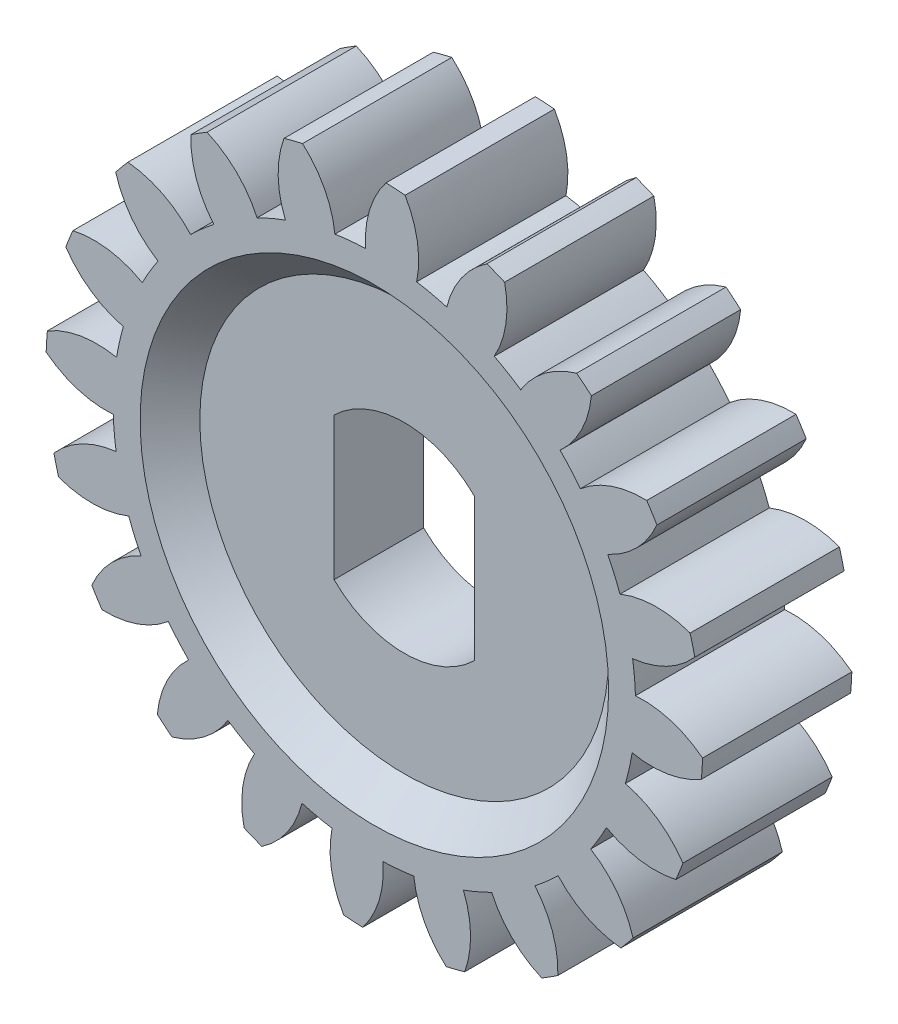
ISO-10303-21;
HEADER;
FILE_DESCRIPTION(('STEP AP214'),'2;1');
FILE_NAME('part.step','',(''),(''),'','','');
FILE_SCHEMA(('AUTOMOTIVE_DESIGN { 1 0 10303 214 1 1 1 1 }'));
ENDSEC;
DATA;
#1=APPLICATION_CONTEXT('core data for automotive mechanical design processes');
#2=APPLICATION_PROTOCOL_DEFINITION('international standard','automotive_design',2000,#1);
#3=PRODUCT_CONTEXT('',#1,'mechanical');
#4=PRODUCT('Part','Part','',(#3));
#5=PRODUCT_RELATED_PRODUCT_CATEGORY('part','',(#4));
#6=PRODUCT_DEFINITION_FORMATION('','',#4);
#7=PRODUCT_DEFINITION_CONTEXT('part definition',#1,'design');
#8=PRODUCT_DEFINITION('design','',#6,#7);
#9=PRODUCT_DEFINITION_SHAPE('','',#8);
#10=(LENGTH_UNIT() NAMED_UNIT(*) SI_UNIT(.MILLI.,.METRE.));
#11=(NAMED_UNIT(*) PLANE_ANGLE_UNIT() SI_UNIT($,.RADIAN.));
#12=(NAMED_UNIT(*) SI_UNIT($,.STERADIAN.) SOLID_ANGLE_UNIT());
#13=UNCERTAINTY_MEASURE_WITH_UNIT(LENGTH_MEASURE(1.E-05),#10,'distance_accuracy_value','');
#14=(GEOMETRIC_REPRESENTATION_CONTEXT(3) GLOBAL_UNCERTAINTY_ASSIGNED_CONTEXT((#13)) GLOBAL_UNIT_ASSIGNED_CONTEXT((#10,
#11,#12)) REPRESENTATION_CONTEXT('',''));
#15=CARTESIAN_POINT('',(0.,0.,0.));
#16=DIRECTION('',(0.,0.,1.));
#17=DIRECTION('',(1.,0.,0.));
#18=AXIS2_PLACEMENT_3D('',#15,#16,#17);
#19=CARTESIAN_POINT('',(0.,0.,0.));
#20=DIRECTION('',(0.,0.,1.));
#21=DIRECTION('',(1.,0.,0.));
#22=AXIS2_PLACEMENT_3D('',#19,#20,#21);
#23=CYLINDRICAL_SURFACE('',#22,3.35);
#24=CARTESIAN_POINT('',(0.,0.,1.));
#25=DIRECTION('',(0.,0.,-1.));
#26=DIRECTION('',(-1.,0.,0.));
#27=AXIS2_PLACEMENT_3D('',#24,#25,#26);
#28=CIRCLE('',#27,3.35);
#29=CARTESIAN_POINT('',(-2.35,-2.38746727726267,1.));
#30=VERTEX_POINT('',#29);
#31=CARTESIAN_POINT('',(2.35,-2.38746727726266,1.));
#32=VERTEX_POINT('',#31);
#33=EDGE_CURVE('E47',#30,#32,#28,.F.);
#34=ORIENTED_EDGE('',*,*,#33,.F.);
#35=DIRECTION('',(0.,0.,1.));
#36=VECTOR('',#35,1.);
#37=CARTESIAN_POINT('',(-2.35,-2.38746727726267,0.));
#38=LINE('',#37,#36);
#39=CARTESIAN_POINT('',(-2.35,-2.38746727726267,4.));
#40=VERTEX_POINT('',#39);
#41=EDGE_CURVE('E571',#30,#40,#38,.T.);
#42=ORIENTED_EDGE('',*,*,#41,.T.);
#43=CARTESIAN_POINT('',(0.,0.,4.));
#44=DIRECTION('',(0.,0.,1.));
#45=DIRECTION('',(1.,0.,0.));
#46=AXIS2_PLACEMENT_3D('',#43,#44,#45);
#47=CIRCLE('',#46,3.35);
#48=CARTESIAN_POINT('',(2.35,-2.38746727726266,4.));
#49=VERTEX_POINT('',#48);
#50=EDGE_CURVE('E573',#49,#40,#47,.F.);
#51=ORIENTED_EDGE('',*,*,#50,.F.);
#52=DIRECTION('',(0.,0.,1.));
#53=VECTOR('',#52,1.);
#54=CARTESIAN_POINT('',(2.35,-2.38746727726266,0.));
#55=LINE('',#54,#53);
#56=EDGE_CURVE('E569',#32,#49,#55,.T.);
#57=ORIENTED_EDGE('',*,*,#56,.F.);
#58=EDGE_LOOP('',(#34,#42,#51,#57));
#59=FACE_BOUND('',#58,.T.);
#60=ADVANCED_FACE('F32',(#59),#23,.F.);
#61=CARTESIAN_POINT('',(-2.35,2.38746727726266,0.));
#62=DIRECTION('',(-1.,0.,0.));
#63=DIRECTION('',(0.,-1.,0.));
#64=AXIS2_PLACEMENT_3D('',#61,#62,#63);
#65=PLANE('',#64);
#66=DIRECTION('',(0.,-1.,0.));
#67=VECTOR('',#66,1.);
#68=CARTESIAN_POINT('',(-2.35,2.38746727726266,1.));
#69=LINE('',#68,#67);
#70=CARTESIAN_POINT('',(-2.35,2.38746727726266,1.));
#71=VERTEX_POINT('',#70);
#72=EDGE_CURVE('E563',#71,#30,#69,.T.);
#73=ORIENTED_EDGE('',*,*,#72,.F.);
#74=DIRECTION('',(0.,0.,1.));
#75=VECTOR('',#74,1.);
#76=CARTESIAN_POINT('',(-2.35,2.38746727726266,0.));
#77=LINE('',#76,#75);
#78=CARTESIAN_POINT('',(-2.35,2.38746727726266,4.));
#79=VERTEX_POINT('',#78);
#80=EDGE_CURVE('E562',#71,#79,#77,.T.);
#81=ORIENTED_EDGE('',*,*,#80,.T.);
#82=DIRECTION('',(0.,1.,0.));
#83=VECTOR('',#82,1.);
#84=CARTESIAN_POINT('',(-2.35,2.38746727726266,4.));
#85=LINE('',#84,#83);
#86=EDGE_CURVE('E2231',#40,#79,#85,.T.);
#87=ORIENTED_EDGE('',*,*,#86,.F.);
#88=ORIENTED_EDGE('',*,*,#41,.F.);
#89=EDGE_LOOP('',(#73,#81,#87,#88));
#90=FACE_BOUND('',#89,.T.);
#91=ADVANCED_FACE('F1165',(#90),#65,.F.);
#92=CARTESIAN_POINT('',(0.,0.,0.));
#93=DIRECTION('',(0.,0.,1.));
#94=DIRECTION('',(1.,0.,0.));
#95=AXIS2_PLACEMENT_3D('',#92,#93,#94);
#96=CYLINDRICAL_SURFACE('',#95,3.35);
#97=CARTESIAN_POINT('',(0.,0.,1.));
#98=DIRECTION('',(0.,0.,-1.));
#99=DIRECTION('',(-1.,0.,0.));
#100=AXIS2_PLACEMENT_3D('',#97,#98,#99);
#101=CIRCLE('',#100,3.35);
#102=CARTESIAN_POINT('',(2.35,2.38746727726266,1.));
#103=VERTEX_POINT('',#102);
#104=EDGE_CURVE('E554',#103,#71,#101,.F.);
#105=ORIENTED_EDGE('',*,*,#104,.F.);
#106=DIRECTION('',(0.,0.,1.));
#107=VECTOR('',#106,1.);
#108=CARTESIAN_POINT('',(2.35,2.38746727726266,0.));
#109=LINE('',#108,#107);
#110=CARTESIAN_POINT('',(2.35,2.38746727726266,4.));
#111=VERTEX_POINT('',#110);
#112=EDGE_CURVE('E55',#103,#111,#109,.T.);
#113=ORIENTED_EDGE('',*,*,#112,.T.);
#114=CARTESIAN_POINT('',(0.,0.,4.));
#115=DIRECTION('',(0.,0.,1.));
#116=DIRECTION('',(1.,0.,0.));
#117=AXIS2_PLACEMENT_3D('',#114,#115,#116);
#118=CIRCLE('',#117,3.35);
#119=EDGE_CURVE('E2234',#79,#111,#118,.F.);
#120=ORIENTED_EDGE('',*,*,#119,.F.);
#121=ORIENTED_EDGE('',*,*,#80,.F.);
#122=EDGE_LOOP('',(#105,#113,#120,#121));
#123=FACE_BOUND('',#122,.T.);
#124=ADVANCED_FACE('F561',(#123),#96,.F.);
#125=CARTESIAN_POINT('',(2.35,2.38746727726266,0.));
#126=DIRECTION('',(1.,0.,0.));
#127=DIRECTION('',(0.,1.,0.));
#128=AXIS2_PLACEMENT_3D('',#125,#126,#127);
#129=PLANE('',#128);
#130=DIRECTION('',(0.,1.,0.));
#131=VECTOR('',#130,1.);
#132=CARTESIAN_POINT('',(2.35,2.38746727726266,1.));
#133=LINE('',#132,#131);
#134=EDGE_CURVE('E552',#32,#103,#133,.T.);
#135=ORIENTED_EDGE('',*,*,#134,.F.);
#136=ORIENTED_EDGE('',*,*,#56,.T.);
#137=DIRECTION('',(0.,-1.,0.));
#138=VECTOR('',#137,1.);
#139=CARTESIAN_POINT('',(2.35,2.38746727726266,4.));
#140=LINE('',#139,#138);
#141=EDGE_CURVE('E558',#111,#49,#140,.T.);
#142=ORIENTED_EDGE('',*,*,#141,.F.);
#143=ORIENTED_EDGE('',*,*,#112,.F.);
#144=EDGE_LOOP('',(#135,#136,#142,#143));
#145=FACE_BOUND('',#144,.T.);
#146=ADVANCED_FACE('F567',(#145),#129,.F.);
#147=CARTESIAN_POINT('',(0.,0.,0.));
#148=DIRECTION('',(0.,0.,1.));
#149=DIRECTION('',(1.,0.,0.));
#150=AXIS2_PLACEMENT_3D('',#147,#148,#149);
#151=PLANE('',#150);
#152=CARTESIAN_POINT('',(0.,0.,0.));
#153=DIRECTION('',(0.,0.,1.));
#154=DIRECTION('',(1.,0.,0.));
#155=AXIS2_PLACEMENT_3D('',#152,#153,#154);
#156=CIRCLE('',#155,7.84618754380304);
#157=CARTESIAN_POINT('',(7.84618754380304,0.,0.));
#158=VERTEX_POINT('',#157);
#159=EDGE_CURVE('E40',#158,#158,#156,.T.);
#160=ORIENTED_EDGE('',*,*,#159,.T.);
#161=EDGE_LOOP('',(#160));
#162=FACE_BOUND('',#161,.T.);
#163=CARTESIAN_POINT('',(0.,0.,0.));
#164=DIRECTION('',(0.,0.,1.));
#165=DIRECTION('',(1.,0.,0.));
#166=AXIS2_PLACEMENT_3D('',#163,#164,#165);
#167=CIRCLE('',#166,8.75000000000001);
#168=CARTESIAN_POINT('',(8.74509786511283,0.29285376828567,0.));
#169=VERTEX_POINT('',#168);
#170=CARTESIAN_POINT('',(8.64972141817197,1.32091611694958,0.));
#171=VERTEX_POINT('',#170);
#172=EDGE_CURVE('E1142',#169,#171,#167,.T.);
#173=ORIENTED_EDGE('',*,*,#172,.F.);
#174=CARTESIAN_POINT('',(8.98454452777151,-2.96012032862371,0.));
#175=DIRECTION('',(0.,0.,1.));
#176=DIRECTION('',(1.,0.,0.));
#177=AXIS2_PLACEMENT_3D('',#174,#175,#176);
#178=CIRCLE('',#177,3.2617748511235);
#179=CARTESIAN_POINT('',(10.9930803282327,-0.390108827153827,0.));
#180=VERTEX_POINT('',#179);
#181=EDGE_CURVE('E1109',#180,#169,#178,.T.);
#182=ORIENTED_EDGE('',*,*,#181,.F.);
#183=CARTESIAN_POINT('',(0.,0.,0.));
#184=DIRECTION('',(0.,0.,1.));
#185=DIRECTION('',(1.,0.,0.));
#186=AXIS2_PLACEMENT_3D('',#183,#184,#185);
#187=CIRCLE('',#186,11.);
#188=CARTESIAN_POINT('',(10.9517769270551,-1.02887421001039,0.));
#189=VERTEX_POINT('',#188);
#190=EDGE_CURVE('E1116',#189,#180,#187,.T.);
#191=ORIENTED_EDGE('',*,*,#190,.F.);
#192=CARTESIAN_POINT('',(9.2909436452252,1.77840347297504,0.));
#193=DIRECTION('',(0.,0.,1.));
#194=DIRECTION('',(-1.,0.,0.));
#195=AXIS2_PLACEMENT_3D('',#192,#193,#194);
#196=CIRCLE('',#195,3.2617748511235);
#197=CARTESIAN_POINT('',(8.63455944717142,-1.41664503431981,0.));
#198=VERTEX_POINT('',#197);
#199=EDGE_CURVE('E1112',#198,#189,#196,.T.);
#200=ORIENTED_EDGE('',*,*,#199,.F.);
#201=CARTESIAN_POINT('',(8.4075791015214,-2.42386337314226,0.));
#202=VERTEX_POINT('',#201);
#203=EDGE_CURVE('E1129',#202,#198,#167,.T.);
#204=ORIENTED_EDGE('',*,*,#203,.F.);
#205=CARTESIAN_POINT('',(7.63008213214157,-5.59161867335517,0.));
#206=DIRECTION('',(0.,0.,1.));
#207=DIRECTION('',(0.951056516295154,-0.309016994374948,0.));
#208=AXIS2_PLACEMENT_3D('',#205,#206,#207);
#209=CIRCLE('',#208,3.2617748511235);
#210=CARTESIAN_POINT('',(10.3344904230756,-3.76806418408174,0.));
#211=VERTEX_POINT('',#210);
#212=EDGE_CURVE('E1081',#211,#202,#209,.T.);
#213=ORIENTED_EDGE('',*,*,#212,.F.);
#214=CARTESIAN_POINT('',(0.,0.,0.));
#215=DIRECTION('',(0.,0.,1.));
#216=DIRECTION('',(0.951056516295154,-0.309016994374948,0.));
#217=AXIS2_PLACEMENT_3D('',#214,#215,#216);
#218=CIRCLE('',#217,11.);
#219=CARTESIAN_POINT('',(10.0978191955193,-4.36280271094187,0.));
#220=VERTEX_POINT('',#219);
#221=EDGE_CURVE('E1088',#220,#211,#218,.T.);
#222=ORIENTED_EDGE('',*,*,#221,.F.);
#223=CARTESIAN_POINT('',(9.38576939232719,-1.17969726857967,0.));
#224=DIRECTION('',(0.,0.,1.));
#225=DIRECTION('',(-0.951056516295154,0.309016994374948,0.));
#226=AXIS2_PLACEMENT_3D('',#223,#224,#225);
#227=CIRCLE('',#226,3.2617748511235);
#228=CARTESIAN_POINT('',(7.77418663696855,-4.01553509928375,0.));
#229=VERTEX_POINT('',#228);
#230=EDGE_CURVE('E1084',#229,#220,#227,.T.);
#231=ORIENTED_EDGE('',*,*,#230,.F.);
#232=CARTESIAN_POINT('',(7.24706791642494,-4.90331587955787,0.));
#233=VERTEX_POINT('',#232);
#234=EDGE_CURVE('E1512',#233,#229,#167,.T.);
#235=ORIENTED_EDGE('',*,*,#234,.F.);
#236=CARTESIAN_POINT('',(5.52873413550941,-7.67577042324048,0.));
#237=DIRECTION('',(0.,0.,1.));
#238=DIRECTION('',(0.809016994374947,-0.587785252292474,0.));
#239=AXIS2_PLACEMENT_3D('',#236,#237,#238);
#240=CIRCLE('',#239,3.2617748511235);
#241=CARTESIAN_POINT('',(8.66428859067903,-6.77717516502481,0.));
#242=VERTEX_POINT('',#241);
#243=EDGE_CURVE('E1053',#242,#233,#240,.T.);
#244=ORIENTED_EDGE('',*,*,#243,.F.);
#245=CARTESIAN_POINT('',(0.,0.,0.));
#246=DIRECTION('',(0.,0.,1.));
#247=DIRECTION('',(0.809016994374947,-0.587785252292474,0.));
#248=AXIS2_PLACEMENT_3D('',#245,#246,#247);
#249=CIRCLE('',#248,11.);
#250=CARTESIAN_POINT('',(8.25541656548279,-7.26966968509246,0.));
#251=VERTEX_POINT('',#250);
#252=EDGE_CURVE('E1060',#251,#242,#249,.T.);
#253=ORIENTED_EDGE('',*,*,#252,.F.);
#254=CARTESIAN_POINT('',(8.56185063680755,-4.02232102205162,0.));
#255=DIRECTION('',(0.,0.,1.));
#256=DIRECTION('',(-0.809016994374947,0.587785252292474,0.));
#257=AXIS2_PLACEMENT_3D('',#254,#255,#256);
#258=CIRCLE('',#257,3.2617748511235);
#259=CARTESIAN_POINT('',(6.15282227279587,-6.22135661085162,0.));
#260=VERTEX_POINT('',#259);
#261=EDGE_CURVE('E1056',#260,#251,#258,.T.);
#262=ORIENTED_EDGE('',*,*,#261,.F.);
#263=CARTESIAN_POINT('',(5.37716323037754,-6.90279766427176,0.));
#264=VERTEX_POINT('',#263);
#265=EDGE_CURVE('E1508',#264,#260,#167,.T.);
#266=ORIENTED_EDGE('',*,*,#265,.F.);
#267=CARTESIAN_POINT('',(2.88619512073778,-9.00856428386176,0.));
#268=DIRECTION('',(0.,0.,1.));
#269=DIRECTION('',(0.587785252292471,-0.809016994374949,0.));
#270=AXIS2_PLACEMENT_3D('',#267,#268,#269);
#271=CIRCLE('',#270,3.2617748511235);
#272=CARTESIAN_POINT('',(6.14596582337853,-9.12288902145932,0.));
#273=VERTEX_POINT('',#272);
#274=EDGE_CURVE('E1025',#273,#264,#271,.T.);
#275=ORIENTED_EDGE('',*,*,#274,.F.);
#276=CARTESIAN_POINT('',(0.,0.,0.));
#277=DIRECTION('',(0.,0.,1.));
#278=DIRECTION('',(0.587785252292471,-0.809016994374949,0.));
#279=AXIS2_PLACEMENT_3D('',#276,#277,#278);
#280=CIRCLE('',#279,11.);
#281=CARTESIAN_POINT('',(5.60491624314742,-9.46493073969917,0.));
#282=VERTEX_POINT('',#281);
#283=EDGE_CURVE('E1032',#282,#273,#280,.T.);
#284=ORIENTED_EDGE('',*,*,#283,.F.);
#285=CARTESIAN_POINT('',(6.89983828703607,-6.47121196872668,0.));
#286=DIRECTION('',(0.,0.,1.));
#287=DIRECTION('',(-0.587785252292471,0.809016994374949,0.));
#288=AXIS2_PLACEMENT_3D('',#285,#286,#287);
#289=CIRCLE('',#288,3.2617748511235);
#290=CARTESIAN_POINT('',(3.92917679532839,-7.81818839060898,0.));
#291=VERTEX_POINT('',#290);
#292=EDGE_CURVE('E1028',#291,#282,#289,.T.);
#293=ORIENTED_EDGE('',*,*,#292,.F.);
#294=CARTESIAN_POINT('',(2.98090434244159,-8.22658551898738,0.));
#295=VERTEX_POINT('',#294);
#296=EDGE_CURVE('E1504',#295,#291,#167,.T.);
#297=ORIENTED_EDGE('',*,*,#296,.F.);
#298=CARTESIAN_POINT('',(-0.038864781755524,-9.45953710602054,0.));
#299=DIRECTION('',(0.,0.,1.));
#300=DIRECTION('',(0.309016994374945,-0.951056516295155,0.));
#301=AXIS2_PLACEMENT_3D('',#298,#299,#300);
#302=CIRCLE('',#301,3.2617748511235);
#303=CARTESIAN_POINT('',(3.02603309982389,-10.575590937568,0.));
#304=VERTEX_POINT('',#303);
#305=EDGE_CURVE('E997',#304,#295,#302,.T.);
#306=ORIENTED_EDGE('',*,*,#305,.F.);
#307=CARTESIAN_POINT('',(0.,0.,0.));
#308=DIRECTION('',(0.,0.,1.));
#309=DIRECTION('',(0.309016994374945,-0.951056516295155,0.));
#310=AXIS2_PLACEMENT_3D('',#307,#308,#309);
#311=CIRCLE('',#310,11.);
#312=CARTESIAN_POINT('',(2.40576766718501,-10.7336984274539,0.));
#313=VERTEX_POINT('',#312);
#314=EDGE_CURVE('E1004',#313,#304,#311,.T.);
#315=ORIENTED_EDGE('',*,*,#314,.F.);
#316=CARTESIAN_POINT('',(4.56242169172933,-8.28665560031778,0.));
#317=DIRECTION('',(0.,0.,1.));
#318=DIRECTION('',(-0.309016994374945,0.951056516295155,0.));
#319=AXIS2_PLACEMENT_3D('',#316,#317,#318);
#320=CIRCLE('',#319,3.2617748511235);
#321=CARTESIAN_POINT('',(1.32091611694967,-8.64972141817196,0.));
#322=VERTEX_POINT('',#321);
#323=EDGE_CURVE('E1000',#322,#313,#320,.T.);
#324=ORIENTED_EDGE('',*,*,#323,.F.);
#325=CARTESIAN_POINT('',(0.29285376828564,-8.74509786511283,0.));
#326=VERTEX_POINT('',#325);
#327=EDGE_CURVE('E1500',#326,#322,#167,.T.);
#328=ORIENTED_EDGE('',*,*,#327,.F.);
#329=CARTESIAN_POINT('',(-2.96012032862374,-8.9845445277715,0.));
#330=DIRECTION('',(0.,0.,1.));
#331=DIRECTION('',(0.,-1.,0.));
#332=AXIS2_PLACEMENT_3D('',#329,#330,#331);
#333=CIRCLE('',#332,3.2617748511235);
#334=CARTESIAN_POINT('',(-0.390108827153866,-10.9930803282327,0.));
#335=VERTEX_POINT('',#334);
#336=EDGE_CURVE('E969',#335,#326,#333,.T.);
#337=ORIENTED_EDGE('',*,*,#336,.F.);
#338=CARTESIAN_POINT('',(0.,0.,0.));
#339=DIRECTION('',(0.,0.,1.));
#340=DIRECTION('',(0.,-1.,0.));
#341=AXIS2_PLACEMENT_3D('',#338,#339,#340);
#342=CIRCLE('',#341,11.);
#343=CARTESIAN_POINT('',(-1.02887421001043,-10.9517769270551,0.));
#344=VERTEX_POINT('',#343);
#345=EDGE_CURVE('E976',#344,#335,#342,.T.);
#346=ORIENTED_EDGE('',*,*,#345,.F.);
#347=CARTESIAN_POINT('',(1.77840347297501,-9.29094364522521,0.));
#348=DIRECTION('',(0.,0.,1.));
#349=DIRECTION('',(0.,1.,0.));
#350=AXIS2_PLACEMENT_3D('',#347,#348,#349);
#351=CIRCLE('',#350,3.2617748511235);
#352=CARTESIAN_POINT('',(-1.41664503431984,-8.63455944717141,0.));
#353=VERTEX_POINT('',#352);
#354=EDGE_CURVE('E972',#353,#344,#351,.T.);
#355=ORIENTED_EDGE('',*,*,#354,.F.);
#356=CARTESIAN_POINT('',(-2.42386337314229,-8.40757910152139,0.));
#357=VERTEX_POINT('',#356);
#358=EDGE_CURVE('E1496',#357,#353,#167,.T.);
#359=ORIENTED_EDGE('',*,*,#358,.F.);
#360=CARTESIAN_POINT('',(-5.5916186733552,-7.63008213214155,0.));
#361=DIRECTION('',(0.,0.,1.));
#362=DIRECTION('',(-0.309016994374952,-0.951056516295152,0.));
#363=AXIS2_PLACEMENT_3D('',#360,#361,#362);
#364=CIRCLE('',#363,3.2617748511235);
#365=CARTESIAN_POINT('',(-3.76806418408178,-10.3344904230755,0.));
#366=VERTEX_POINT('',#365);
#367=EDGE_CURVE('E941',#366,#357,#364,.T.);
#368=ORIENTED_EDGE('',*,*,#367,.F.);
#369=CARTESIAN_POINT('',(0.,0.,0.));
#370=DIRECTION('',(0.,0.,1.));
#371=DIRECTION('',(-0.309016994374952,-0.951056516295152,0.));
#372=AXIS2_PLACEMENT_3D('',#369,#370,#371);
#373=CIRCLE('',#372,11.);
#374=CARTESIAN_POINT('',(-4.36280271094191,-10.0978191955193,0.));
#375=VERTEX_POINT('',#374);
#376=EDGE_CURVE('E948',#375,#366,#373,.T.);
#377=ORIENTED_EDGE('',*,*,#376,.F.);
#378=CARTESIAN_POINT('',(-1.17969726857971,-9.38576939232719,0.));
#379=DIRECTION('',(0.,0.,1.));
#380=DIRECTION('',(0.309016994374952,0.951056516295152,0.));
#381=AXIS2_PLACEMENT_3D('',#378,#379,#380);
#382=CIRCLE('',#381,3.2617748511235);
#383=CARTESIAN_POINT('',(-4.01553509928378,-7.77418663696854,0.));
#384=VERTEX_POINT('',#383);
#385=EDGE_CURVE('E944',#384,#375,#382,.T.);
#386=ORIENTED_EDGE('',*,*,#385,.F.);
#387=CARTESIAN_POINT('',(-4.90331587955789,-7.24706791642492,0.));
#388=VERTEX_POINT('',#387);
#389=EDGE_CURVE('E1492',#388,#384,#167,.T.);
#390=ORIENTED_EDGE('',*,*,#389,.F.);
#391=CARTESIAN_POINT('',(-7.6757704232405,-5.52873413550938,0.));
#392=DIRECTION('',(0.,0.,1.));
#393=DIRECTION('',(-0.587785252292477,-0.809016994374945,0.));
#394=AXIS2_PLACEMENT_3D('',#391,#392,#393);
#395=CIRCLE('',#394,3.2617748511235);
#396=CARTESIAN_POINT('',(-6.77717516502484,-8.66428859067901,0.));
#397=VERTEX_POINT('',#396);
#398=EDGE_CURVE('E913',#397,#388,#395,.T.);
#399=ORIENTED_EDGE('',*,*,#398,.F.);
#400=CARTESIAN_POINT('',(0.,0.,0.));
#401=DIRECTION('',(0.,0.,1.));
#402=DIRECTION('',(-0.587785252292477,-0.809016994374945,0.));
#403=AXIS2_PLACEMENT_3D('',#400,#401,#402);
#404=CIRCLE('',#403,11.);
#405=CARTESIAN_POINT('',(-7.26966968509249,-8.25541656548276,0.));
#406=VERTEX_POINT('',#405);
#407=EDGE_CURVE('E920',#406,#397,#404,.T.);
#408=ORIENTED_EDGE('',*,*,#407,.F.);
#409=CARTESIAN_POINT('',(-4.02232102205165,-8.56185063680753,0.));
#410=DIRECTION('',(0.,0.,1.));
#411=DIRECTION('',(0.587785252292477,0.809016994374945,0.));
#412=AXIS2_PLACEMENT_3D('',#409,#410,#411);
#413=CIRCLE('',#412,3.2617748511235);
#414=CARTESIAN_POINT('',(-6.22135661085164,-6.15282227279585,0.));
#415=VERTEX_POINT('',#414);
#416=EDGE_CURVE('E916',#415,#406,#413,.T.);
#417=ORIENTED_EDGE('',*,*,#416,.F.);
#418=CARTESIAN_POINT('',(-6.90279766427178,-5.37716323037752,0.));
#419=VERTEX_POINT('',#418);
#420=EDGE_CURVE('E1488',#419,#415,#167,.T.);
#421=ORIENTED_EDGE('',*,*,#420,.F.);
#422=CARTESIAN_POINT('',(-9.00856428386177,-2.88619512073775,0.));
#423=DIRECTION('',(0.,0.,1.));
#424=DIRECTION('',(-0.809016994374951,-0.587785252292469,0.));
#425=AXIS2_PLACEMENT_3D('',#422,#423,#424);
#426=CIRCLE('',#425,3.2617748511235);
#427=CARTESIAN_POINT('',(-9.12288902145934,-6.1459658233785,0.));
#428=VERTEX_POINT('',#427);
#429=EDGE_CURVE('E885',#428,#419,#426,.T.);
#430=ORIENTED_EDGE('',*,*,#429,.F.);
#431=CARTESIAN_POINT('',(0.,0.,0.));
#432=DIRECTION('',(0.,0.,1.));
#433=DIRECTION('',(-0.809016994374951,-0.587785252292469,0.));
#434=AXIS2_PLACEMENT_3D('',#431,#432,#433);
#435=CIRCLE('',#434,11.);
#436=CARTESIAN_POINT('',(-9.46493073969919,-5.60491624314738,0.));
#437=VERTEX_POINT('',#436);
#438=EDGE_CURVE('E892',#437,#428,#435,.T.);
#439=ORIENTED_EDGE('',*,*,#438,.F.);
#440=CARTESIAN_POINT('',(-6.47121196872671,-6.89983828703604,0.));
#441=DIRECTION('',(0.,0.,1.));
#442=DIRECTION('',(0.809016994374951,0.587785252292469,0.));
#443=AXIS2_PLACEMENT_3D('',#440,#441,#442);
#444=CIRCLE('',#443,3.2617748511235);
#445=CARTESIAN_POINT('',(-7.818188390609,-3.92917679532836,0.));
#446=VERTEX_POINT('',#445);
#447=EDGE_CURVE('E888',#446,#437,#444,.T.);
#448=ORIENTED_EDGE('',*,*,#447,.F.);
#449=CARTESIAN_POINT('',(-8.2265855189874,-2.98090434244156,0.));
#450=VERTEX_POINT('',#449);
#451=EDGE_CURVE('E1484',#450,#446,#167,.T.);
#452=ORIENTED_EDGE('',*,*,#451,.F.);
#453=CARTESIAN_POINT('',(-9.45953710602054,0.0388647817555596,0.));
#454=DIRECTION('',(0.,0.,1.));
#455=DIRECTION('',(-0.951056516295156,-0.309016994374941,0.));
#456=AXIS2_PLACEMENT_3D('',#453,#454,#455);
#457=CIRCLE('',#456,3.2617748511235);
#458=CARTESIAN_POINT('',(-10.575590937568,-3.02603309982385,0.));
#459=VERTEX_POINT('',#458);
#460=EDGE_CURVE('E857',#459,#450,#457,.T.);
#461=ORIENTED_EDGE('',*,*,#460,.F.);
#462=CARTESIAN_POINT('',(0.,0.,0.));
#463=DIRECTION('',(0.,0.,1.));
#464=DIRECTION('',(-0.951056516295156,-0.309016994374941,0.));
#465=AXIS2_PLACEMENT_3D('',#462,#463,#464);
#466=CIRCLE('',#465,11.);
#467=CARTESIAN_POINT('',(-10.7336984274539,-2.40576766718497,0.));
#468=VERTEX_POINT('',#467);
#469=EDGE_CURVE('E864',#468,#459,#466,.T.);
#470=ORIENTED_EDGE('',*,*,#469,.F.);
#471=CARTESIAN_POINT('',(-8.28665560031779,-4.5624216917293,0.));
#472=DIRECTION('',(0.,0.,1.));
#473=DIRECTION('',(0.951056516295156,0.309016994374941,0.));
#474=AXIS2_PLACEMENT_3D('',#471,#472,#473);
#475=CIRCLE('',#474,3.2617748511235);
#476=CARTESIAN_POINT('',(-8.64972141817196,-1.32091611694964,0.));
#477=VERTEX_POINT('',#476);
#478=EDGE_CURVE('E860',#477,#468,#475,.T.);
#479=ORIENTED_EDGE('',*,*,#478,.F.);
#480=CARTESIAN_POINT('',(-8.74509786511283,-0.292853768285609,0.));
#481=VERTEX_POINT('',#480);
#482=EDGE_CURVE('E1480',#481,#477,#167,.T.);
#483=ORIENTED_EDGE('',*,*,#482,.F.);
#484=CARTESIAN_POINT('',(-8.98454452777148,2.96012032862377,0.));
#485=DIRECTION('',(0.,0.,1.));
#486=DIRECTION('',(-1.,0.,0.));
#487=AXIS2_PLACEMENT_3D('',#484,#485,#486);
#488=CIRCLE('',#487,3.2617748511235);
#489=CARTESIAN_POINT('',(-10.9930803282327,0.390108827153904,0.));
#490=VERTEX_POINT('',#489);
#491=EDGE_CURVE('E829',#490,#481,#488,.T.);
#492=ORIENTED_EDGE('',*,*,#491,.F.);
#493=CARTESIAN_POINT('',(0.,0.,0.));
#494=DIRECTION('',(0.,0.,1.));
#495=DIRECTION('',(-1.,0.,0.));
#496=AXIS2_PLACEMENT_3D('',#493,#494,#495);
#497=CIRCLE('',#496,11.);
#498=CARTESIAN_POINT('',(-10.951776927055,1.02887421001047,0.));
#499=VERTEX_POINT('',#498);
#500=EDGE_CURVE('E836',#499,#490,#497,.T.);
#501=ORIENTED_EDGE('',*,*,#500,.F.);
#502=CARTESIAN_POINT('',(-9.29094364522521,-1.77840347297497,0.));
#503=DIRECTION('',(0.,0.,1.));
#504=DIRECTION('',(1.,0.,0.));
#505=AXIS2_PLACEMENT_3D('',#502,#503,#504);
#506=CIRCLE('',#505,3.2617748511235);
#507=CARTESIAN_POINT('',(-8.63455944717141,1.41664503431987,0.));
#508=VERTEX_POINT('',#507);
#509=EDGE_CURVE('E832',#508,#499,#506,.T.);
#510=ORIENTED_EDGE('',*,*,#509,.F.);
#511=CARTESIAN_POINT('',(-8.40757910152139,2.42386337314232,0.));
#512=VERTEX_POINT('',#511);
#513=EDGE_CURVE('E1476',#512,#508,#167,.T.);
#514=ORIENTED_EDGE('',*,*,#513,.F.);
#515=CARTESIAN_POINT('',(-7.63008213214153,5.59161867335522,0.));
#516=DIRECTION('',(0.,0.,1.));
#517=DIRECTION('',(-0.951056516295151,0.309016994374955,0.));
#518=AXIS2_PLACEMENT_3D('',#515,#516,#517);
#519=CIRCLE('',#518,3.2617748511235);
#520=CARTESIAN_POINT('',(-10.3344904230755,3.76806418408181,0.));
#521=VERTEX_POINT('',#520);
#522=EDGE_CURVE('E801',#521,#512,#519,.T.);
#523=ORIENTED_EDGE('',*,*,#522,.F.);
#524=CARTESIAN_POINT('',(0.,0.,0.));
#525=DIRECTION('',(0.,0.,1.));
#526=DIRECTION('',(-0.951056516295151,0.309016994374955,0.));
#527=AXIS2_PLACEMENT_3D('',#524,#525,#526);
#528=CIRCLE('',#527,11.);
#529=CARTESIAN_POINT('',(-10.0978191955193,4.36280271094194,0.));
#530=VERTEX_POINT('',#529);
#531=EDGE_CURVE('E808',#530,#521,#528,.T.);
#532=ORIENTED_EDGE('',*,*,#531,.F.);
#533=CARTESIAN_POINT('',(-9.38576939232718,1.17969726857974,0.));
#534=DIRECTION('',(0.,0.,1.));
#535=DIRECTION('',(0.951056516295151,-0.309016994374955,0.));
#536=AXIS2_PLACEMENT_3D('',#533,#534,#535);
#537=CIRCLE('',#536,3.2617748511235);
#538=CARTESIAN_POINT('',(-7.77418663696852,4.0155350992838,0.));
#539=VERTEX_POINT('',#538);
#540=EDGE_CURVE('E804',#539,#530,#537,.T.);
#541=ORIENTED_EDGE('',*,*,#540,.F.);
#542=CARTESIAN_POINT('',(-7.2470679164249,4.90331587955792,0.));
#543=VERTEX_POINT('',#542);
#544=EDGE_CURVE('E1472',#543,#539,#167,.T.);
#545=ORIENTED_EDGE('',*,*,#544,.F.);
#546=CARTESIAN_POINT('',(-5.52873413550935,7.67577042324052,0.));
#547=DIRECTION('',(0.,0.,1.));
#548=DIRECTION('',(-0.809016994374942,0.58778525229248,0.));
#549=AXIS2_PLACEMENT_3D('',#546,#547,#548);
#550=CIRCLE('',#549,3.2617748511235);
#551=CARTESIAN_POINT('',(-8.66428859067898,6.77717516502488,0.));
#552=VERTEX_POINT('',#551);
#553=EDGE_CURVE('E773',#552,#543,#550,.T.);
#554=ORIENTED_EDGE('',*,*,#553,.F.);
#555=CARTESIAN_POINT('',(0.,0.,0.));
#556=DIRECTION('',(0.,0.,1.));
#557=DIRECTION('',(-0.809016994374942,0.58778525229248,0.));
#558=AXIS2_PLACEMENT_3D('',#555,#556,#557);
#559=CIRCLE('',#558,11.);
#560=CARTESIAN_POINT('',(-8.25541656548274,7.26966968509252,0.));
#561=VERTEX_POINT('',#560);
#562=EDGE_CURVE('E780',#561,#552,#559,.T.);
#563=ORIENTED_EDGE('',*,*,#562,.F.);
#564=CARTESIAN_POINT('',(-8.56185063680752,4.02232102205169,0.));
#565=DIRECTION('',(0.,0.,1.));
#566=DIRECTION('',(0.809016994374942,-0.58778525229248,0.));
#567=AXIS2_PLACEMENT_3D('',#564,#565,#566);
#568=CIRCLE('',#567,3.2617748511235);
#569=CARTESIAN_POINT('',(-6.15282227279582,6.22135661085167,0.));
#570=VERTEX_POINT('',#569);
#571=EDGE_CURVE('E776',#570,#561,#568,.T.);
#572=ORIENTED_EDGE('',*,*,#571,.F.);
#573=CARTESIAN_POINT('',(-5.37716323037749,6.9027976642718,0.));
#574=VERTEX_POINT('',#573);
#575=EDGE_CURVE('E1468',#574,#570,#167,.T.);
#576=ORIENTED_EDGE('',*,*,#575,.F.);
#577=CARTESIAN_POINT('',(-2.88619512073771,9.00856428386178,0.));
#578=DIRECTION('',(0.,0.,1.));
#579=DIRECTION('',(-0.587785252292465,0.809016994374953,0.));
#580=AXIS2_PLACEMENT_3D('',#577,#578,#579);
#581=CIRCLE('',#580,3.2617748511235);
#582=CARTESIAN_POINT('',(-6.14596582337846,9.12288902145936,0.));
#583=VERTEX_POINT('',#582);
#584=EDGE_CURVE('E745',#583,#574,#581,.T.);
#585=ORIENTED_EDGE('',*,*,#584,.F.);
#586=CARTESIAN_POINT('',(0.,0.,0.));
#587=DIRECTION('',(0.,0.,1.));
#588=DIRECTION('',(-0.587785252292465,0.809016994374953,0.));
#589=AXIS2_PLACEMENT_3D('',#586,#587,#588);
#590=CIRCLE('',#589,11.);
#591=CARTESIAN_POINT('',(-5.60491624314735,9.46493073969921,0.));
#592=VERTEX_POINT('',#591);
#593=EDGE_CURVE('E752',#592,#583,#590,.T.);
#594=ORIENTED_EDGE('',*,*,#593,.F.);
#595=CARTESIAN_POINT('',(-6.89983828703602,6.47121196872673,0.));
#596=DIRECTION('',(0.,0.,1.));
#597=DIRECTION('',(0.587785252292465,-0.809016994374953,0.));
#598=AXIS2_PLACEMENT_3D('',#595,#596,#597);
#599=CIRCLE('',#598,3.2617748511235);
#600=CARTESIAN_POINT('',(-3.92917679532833,7.81818839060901,0.));
#601=VERTEX_POINT('',#600);
#602=EDGE_CURVE('E748',#601,#592,#599,.T.);
#603=ORIENTED_EDGE('',*,*,#602,.F.);
#604=CARTESIAN_POINT('',(-2.98090434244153,8.2265855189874,0.));
#605=VERTEX_POINT('',#604);
#606=EDGE_CURVE('E1464',#605,#601,#167,.T.);
#607=ORIENTED_EDGE('',*,*,#606,.F.);
#608=CARTESIAN_POINT('',(0.0388647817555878,9.45953710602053,0.));
#609=DIRECTION('',(0.,0.,1.));
#610=DIRECTION('',(-0.309016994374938,0.951056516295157,0.));
#611=AXIS2_PLACEMENT_3D('',#608,#609,#610);
#612=CIRCLE('',#611,3.2617748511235);
#613=CARTESIAN_POINT('',(-3.02603309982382,10.575590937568,0.));
#614=VERTEX_POINT('',#613);
#615=EDGE_CURVE('E717',#614,#605,#612,.T.);
#616=ORIENTED_EDGE('',*,*,#615,.F.);
#617=CARTESIAN_POINT('',(0.,0.,0.));
#618=DIRECTION('',(0.,0.,1.));
#619=DIRECTION('',(-0.309016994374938,0.951056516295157,0.));
#620=AXIS2_PLACEMENT_3D('',#617,#618,#619);
#621=CIRCLE('',#620,11.);
#622=CARTESIAN_POINT('',(-2.40576766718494,10.733698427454,0.));
#623=VERTEX_POINT('',#622);
#624=EDGE_CURVE('E724',#623,#614,#621,.T.);
#625=ORIENTED_EDGE('',*,*,#624,.F.);
#626=CARTESIAN_POINT('',(-4.56242169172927,8.2866556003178,0.));
#627=DIRECTION('',(0.,0.,1.));
#628=DIRECTION('',(0.309016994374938,-0.951056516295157,0.));
#629=AXIS2_PLACEMENT_3D('',#626,#627,#628);
#630=CIRCLE('',#629,3.2617748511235);
#631=CARTESIAN_POINT('',(-1.32091611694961,8.64972141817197,0.));
#632=VERTEX_POINT('',#631);
#633=EDGE_CURVE('E720',#632,#623,#630,.T.);
#634=ORIENTED_EDGE('',*,*,#633,.F.);
#635=CARTESIAN_POINT('',(-0.292853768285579,8.74509786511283,0.));
#636=VERTEX_POINT('',#635);
#637=EDGE_CURVE('E1460',#636,#632,#167,.T.);
#638=ORIENTED_EDGE('',*,*,#637,.F.);
#639=CARTESIAN_POINT('',(2.9601203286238,8.98454452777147,0.));
#640=DIRECTION('',(0.,0.,1.));
#641=DIRECTION('',(0.,1.,0.));
#642=AXIS2_PLACEMENT_3D('',#639,#640,#641);
#643=CIRCLE('',#642,3.2617748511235);
#644=CARTESIAN_POINT('',(0.390108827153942,10.9930803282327,0.));
#645=VERTEX_POINT('',#644);
#646=EDGE_CURVE('E689',#645,#636,#643,.T.);
#647=ORIENTED_EDGE('',*,*,#646,.F.);
#648=CARTESIAN_POINT('',(0.,0.,0.));
#649=DIRECTION('',(0.,0.,1.));
#650=DIRECTION('',(0.,1.,0.));
#651=AXIS2_PLACEMENT_3D('',#648,#649,#650);
#652=CIRCLE('',#651,11.);
#653=CARTESIAN_POINT('',(1.02887421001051,10.951776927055,0.));
#654=VERTEX_POINT('',#653);
#655=EDGE_CURVE('E696',#654,#645,#652,.T.);
#656=ORIENTED_EDGE('',*,*,#655,.F.);
#657=CARTESIAN_POINT('',(-1.77840347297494,9.29094364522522,0.));
#658=DIRECTION('',(0.,0.,1.));
#659=DIRECTION('',(0.,-1.,0.));
#660=AXIS2_PLACEMENT_3D('',#657,#658,#659);
#661=CIRCLE('',#660,3.2617748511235);
#662=CARTESIAN_POINT('',(1.4166450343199,8.6345594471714,0.));
#663=VERTEX_POINT('',#662);
#664=EDGE_CURVE('E692',#663,#654,#661,.T.);
#665=ORIENTED_EDGE('',*,*,#664,.F.);
#666=CARTESIAN_POINT('',(2.42386337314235,8.40757910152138,0.));
#667=VERTEX_POINT('',#666);
#668=EDGE_CURVE('E1456',#667,#663,#167,.T.);
#669=ORIENTED_EDGE('',*,*,#668,.F.);
#670=CARTESIAN_POINT('',(5.59161867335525,7.63008213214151,0.));
#671=DIRECTION('',(0.,0.,1.));
#672=DIRECTION('',(0.309016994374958,0.95105651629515,0.));
#673=AXIS2_PLACEMENT_3D('',#670,#671,#672);
#674=CIRCLE('',#673,3.2617748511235);
#675=CARTESIAN_POINT('',(3.76806418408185,10.3344904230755,0.));
#676=VERTEX_POINT('',#675);
#677=EDGE_CURVE('E661',#676,#667,#674,.T.);
#678=ORIENTED_EDGE('',*,*,#677,.F.);
#679=CARTESIAN_POINT('',(0.,0.,0.));
#680=DIRECTION('',(0.,0.,1.));
#681=DIRECTION('',(0.309016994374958,0.95105651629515,0.));
#682=AXIS2_PLACEMENT_3D('',#679,#680,#681);
#683=CIRCLE('',#682,11.);
#684=CARTESIAN_POINT('',(4.36280271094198,10.0978191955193,0.));
#685=VERTEX_POINT('',#684);
#686=EDGE_CURVE('E668',#685,#676,#683,.T.);
#687=ORIENTED_EDGE('',*,*,#686,.F.);
#688=CARTESIAN_POINT('',(1.17969726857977,9.38576939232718,0.));
#689=DIRECTION('',(0.,0.,1.));
#690=DIRECTION('',(-0.309016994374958,-0.95105651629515,0.));
#691=AXIS2_PLACEMENT_3D('',#688,#689,#690);
#692=CIRCLE('',#691,3.2617748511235);
#693=CARTESIAN_POINT('',(4.01553509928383,7.77418663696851,0.));
#694=VERTEX_POINT('',#693);
#695=EDGE_CURVE('E664',#694,#685,#692,.T.);
#696=ORIENTED_EDGE('',*,*,#695,.F.);
#697=CARTESIAN_POINT('',(4.90331587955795,7.24706791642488,0.));
#698=VERTEX_POINT('',#697);
#699=EDGE_CURVE('E1453',#698,#694,#167,.T.);
#700=ORIENTED_EDGE('',*,*,#699,.F.);
#701=CARTESIAN_POINT('',(7.67577042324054,5.52873413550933,0.));
#702=DIRECTION('',(0.,0.,1.));
#703=DIRECTION('',(0.587785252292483,0.80901699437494,0.));
#704=AXIS2_PLACEMENT_3D('',#701,#702,#703);
#705=CIRCLE('',#704,3.2617748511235);
#706=CARTESIAN_POINT('',(6.77717516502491,8.66428859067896,0.));
#707=VERTEX_POINT('',#706);
#708=EDGE_CURVE('E633',#707,#698,#705,.T.);
#709=ORIENTED_EDGE('',*,*,#708,.F.);
#710=CARTESIAN_POINT('',(0.,0.,0.));
#711=DIRECTION('',(0.,0.,1.));
#712=DIRECTION('',(0.587785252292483,0.80901699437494,0.));
#713=AXIS2_PLACEMENT_3D('',#710,#711,#712);
#714=CIRCLE('',#713,11.);
#715=CARTESIAN_POINT('',(7.26966968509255,8.25541656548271,0.));
#716=VERTEX_POINT('',#715);
#717=EDGE_CURVE('E640',#716,#707,#714,.T.);
#718=ORIENTED_EDGE('',*,*,#717,.F.);
#719=CARTESIAN_POINT('',(4.02232102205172,8.56185063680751,0.));
#720=DIRECTION('',(0.,0.,1.));
#721=DIRECTION('',(-0.587785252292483,-0.80901699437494,0.));
#722=AXIS2_PLACEMENT_3D('',#719,#720,#721);
#723=CIRCLE('',#722,3.2617748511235);
#724=CARTESIAN_POINT('',(6.22135661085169,6.15282227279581,0.));
#725=VERTEX_POINT('',#724);
#726=EDGE_CURVE('E636',#725,#716,#723,.T.);
#727=ORIENTED_EDGE('',*,*,#726,.F.);
#728=CARTESIAN_POINT('',(6.90279766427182,5.37716323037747,0.));
#729=VERTEX_POINT('',#728);
#730=EDGE_CURVE('E1452',#729,#725,#167,.T.);
#731=ORIENTED_EDGE('',*,*,#730,.F.);
#732=CARTESIAN_POINT('',(9.00856428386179,2.88619512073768,0.));
#733=DIRECTION('',(0.,0.,1.));
#734=DIRECTION('',(0.809016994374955,0.587785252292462,0.));
#735=AXIS2_PLACEMENT_3D('',#732,#733,#734);
#736=CIRCLE('',#735,3.2617748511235);
#737=CARTESIAN_POINT('',(9.12288902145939,6.14596582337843,0.));
#738=VERTEX_POINT('',#737);
#739=EDGE_CURVE('E605',#738,#729,#736,.T.);
#740=ORIENTED_EDGE('',*,*,#739,.F.);
#741=CARTESIAN_POINT('',(0.,0.,0.));
#742=DIRECTION('',(0.,0.,1.));
#743=DIRECTION('',(0.809016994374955,0.587785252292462,0.));
#744=AXIS2_PLACEMENT_3D('',#741,#742,#743);
#745=CIRCLE('',#744,11.);
#746=CARTESIAN_POINT('',(9.46493073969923,5.60491624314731,0.));
#747=VERTEX_POINT('',#746);
#748=EDGE_CURVE('E612',#747,#738,#745,.T.);
#749=ORIENTED_EDGE('',*,*,#748,.F.);
#750=CARTESIAN_POINT('',(6.47121196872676,6.89983828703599,0.));
#751=DIRECTION('',(0.,0.,1.));
#752=DIRECTION('',(-0.809016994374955,-0.587785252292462,0.));
#753=AXIS2_PLACEMENT_3D('',#750,#751,#752);
#754=CIRCLE('',#753,3.2617748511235);
#755=CARTESIAN_POINT('',(7.81818839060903,3.9291767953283,0.));
#756=VERTEX_POINT('',#755);
#757=EDGE_CURVE('E608',#756,#747,#754,.T.);
#758=ORIENTED_EDGE('',*,*,#757,.F.);
#759=CARTESIAN_POINT('',(8.22658551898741,2.9809043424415,0.));
#760=VERTEX_POINT('',#759);
#761=EDGE_CURVE('E1144',#760,#756,#167,.T.);
#762=ORIENTED_EDGE('',*,*,#761,.F.);
#763=CARTESIAN_POINT('',(9.45953710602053,-0.0388647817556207,0.));
#764=DIRECTION('',(0.,0.,1.));
#765=DIRECTION('',(0.951056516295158,0.309016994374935,0.));
#766=AXIS2_PLACEMENT_3D('',#763,#764,#765);
#767=CIRCLE('',#766,3.2617748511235);
#768=CARTESIAN_POINT('',(10.575590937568,3.02603309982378,0.));
#769=VERTEX_POINT('',#768);
#770=EDGE_CURVE('E577',#769,#760,#767,.T.);
#771=ORIENTED_EDGE('',*,*,#770,.F.);
#772=CARTESIAN_POINT('',(0.,0.,0.));
#773=DIRECTION('',(0.,0.,1.));
#774=DIRECTION('',(0.951056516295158,0.309016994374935,0.));
#775=AXIS2_PLACEMENT_3D('',#772,#773,#774);
#776=CIRCLE('',#775,11.);
#777=CARTESIAN_POINT('',(10.733698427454,2.4057676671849,0.));
#778=VERTEX_POINT('',#777);
#779=EDGE_CURVE('E584',#778,#769,#776,.T.);
#780=ORIENTED_EDGE('',*,*,#779,.F.);
#781=CARTESIAN_POINT('',(8.28665560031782,4.56242169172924,0.));
#782=DIRECTION('',(0.,0.,1.));
#783=DIRECTION('',(-0.951056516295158,-0.309016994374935,0.));
#784=AXIS2_PLACEMENT_3D('',#781,#782,#783);
#785=CIRCLE('',#784,3.2617748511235);
#786=EDGE_CURVE('E580',#171,#778,#785,.T.);
#787=ORIENTED_EDGE('',*,*,#786,.F.);
#788=EDGE_LOOP('',(#173,#182,#191,#200,#204,#213,#222,#231,#235,#244,#253,#262,#266,#275,#284,
#293,#297,#306,#315,#324,#328,#337,#346,#355,#359,#368,#377,#386,#390,#399,#408,#417,#421,#430,
#439,#448,#452,#461,#470,#479,#483,#492,#501,#510,#514,#523,#532,#541,#545,#554,#563,#572,#576,
#585,#594,#603,#607,#616,#625,#634,#638,#647,#656,#665,#669,#678,#687,#696,#700,#709,#718,#727,
#731,#740,#749,#758,#762,#771,#780,#787));
#789=FACE_BOUND('',#788,.T.);
#790=ADVANCED_FACE('F1148',(#162,#789),#151,.F.);
#791=CARTESIAN_POINT('',(0.,0.,5.));
#792=DIRECTION('',(0.,0.,-1.));
#793=DIRECTION('',(-1.,0.,0.));
#794=AXIS2_PLACEMENT_3D('',#791,#792,#793);
#795=CYLINDRICAL_SURFACE('',#794,8.75000000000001);
#796=CARTESIAN_POINT('',(0.,0.,5.));
#797=DIRECTION('',(0.,0.,1.));
#798=DIRECTION('',(1.,0.,0.));
#799=AXIS2_PLACEMENT_3D('',#796,#797,#798);
#800=CIRCLE('',#799,8.75000000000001);
#801=CARTESIAN_POINT('',(8.22658551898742,2.98090434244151,5.));
#802=VERTEX_POINT('',#801);
#803=CARTESIAN_POINT('',(7.81818839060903,3.9291767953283,5.));
#804=VERTEX_POINT('',#803);
#805=EDGE_CURVE('E1140',#802,#804,#800,.T.);
#806=ORIENTED_EDGE('',*,*,#805,.F.);
#807=DIRECTION('',(0.,0.,1.));
#808=VECTOR('',#807,1.);
#809=CARTESIAN_POINT('',(8.22658551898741,2.9809043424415,0.));
#810=LINE('',#809,#808);
#811=EDGE_CURVE('E587',#760,#802,#810,.T.);
#812=ORIENTED_EDGE('',*,*,#811,.F.);
#813=ORIENTED_EDGE('',*,*,#761,.T.);
#814=DIRECTION('',(0.,0.,1.));
#815=VECTOR('',#814,1.);
#816=CARTESIAN_POINT('',(7.81818839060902,3.9291767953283,0.));
#817=LINE('',#816,#815);
#818=EDGE_CURVE('E628',#756,#804,#817,.T.);
#819=ORIENTED_EDGE('',*,*,#818,.T.);
#820=EDGE_LOOP('',(#806,#812,#813,#819));
#821=FACE_BOUND('',#820,.T.);
#822=ADVANCED_FACE('F1422',(#821),#795,.T.);
#823=CARTESIAN_POINT('',(6.90279766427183,5.37716323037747,5.));
#824=VERTEX_POINT('',#823);
#825=CARTESIAN_POINT('',(6.22135661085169,6.15282227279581,5.));
#826=VERTEX_POINT('',#825);
#827=EDGE_CURVE('E1443',#824,#826,#800,.T.);
#828=ORIENTED_EDGE('',*,*,#827,.F.);
#829=DIRECTION('',(0.,0.,1.));
#830=VECTOR('',#829,1.);
#831=CARTESIAN_POINT('',(6.90279766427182,5.37716323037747,0.));
#832=LINE('',#831,#830);
#833=EDGE_CURVE('E615',#729,#824,#832,.T.);
#834=ORIENTED_EDGE('',*,*,#833,.F.);
#835=ORIENTED_EDGE('',*,*,#730,.T.);
#836=DIRECTION('',(0.,0.,1.));
#837=VECTOR('',#836,1.);
#838=CARTESIAN_POINT('',(6.22135661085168,6.1528222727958,0.));
#839=LINE('',#838,#837);
#840=EDGE_CURVE('E656',#725,#826,#839,.T.);
#841=ORIENTED_EDGE('',*,*,#840,.T.);
#842=EDGE_LOOP('',(#828,#834,#835,#841));
#843=FACE_BOUND('',#842,.T.);
#844=ADVANCED_FACE('F1432',(#843),#795,.T.);
#845=CARTESIAN_POINT('',(4.90331587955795,7.24706791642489,5.));
#846=VERTEX_POINT('',#845);
#847=CARTESIAN_POINT('',(4.01553509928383,7.77418663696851,5.));
#848=VERTEX_POINT('',#847);
#849=EDGE_CURVE('E1544',#846,#848,#800,.T.);
#850=ORIENTED_EDGE('',*,*,#849,.F.);
#851=DIRECTION('',(0.,0.,1.));
#852=VECTOR('',#851,1.);
#853=CARTESIAN_POINT('',(4.90331587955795,7.24706791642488,0.));
#854=LINE('',#853,#852);
#855=EDGE_CURVE('E643',#698,#846,#854,.T.);
#856=ORIENTED_EDGE('',*,*,#855,.F.);
#857=ORIENTED_EDGE('',*,*,#699,.T.);
#858=DIRECTION('',(0.,0.,1.));
#859=VECTOR('',#858,1.);
#860=CARTESIAN_POINT('',(4.01553509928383,7.7741866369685,0.));
#861=LINE('',#860,#859);
#862=EDGE_CURVE('E684',#694,#848,#861,.T.);
#863=ORIENTED_EDGE('',*,*,#862,.T.);
#864=EDGE_LOOP('',(#850,#856,#857,#863));
#865=FACE_BOUND('',#864,.T.);
#866=ADVANCED_FACE('F1437',(#865),#795,.T.);
#867=CARTESIAN_POINT('',(2.42386337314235,8.40757910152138,5.));
#868=VERTEX_POINT('',#867);
#869=CARTESIAN_POINT('',(1.4166450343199,8.6345594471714,5.));
#870=VERTEX_POINT('',#869);
#871=EDGE_CURVE('E1543',#868,#870,#800,.T.);
#872=ORIENTED_EDGE('',*,*,#871,.F.);
#873=DIRECTION('',(0.,0.,1.));
#874=VECTOR('',#873,1.);
#875=CARTESIAN_POINT('',(2.42386337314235,8.40757910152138,0.));
#876=LINE('',#875,#874);
#877=EDGE_CURVE('E671',#667,#868,#876,.T.);
#878=ORIENTED_EDGE('',*,*,#877,.F.);
#879=ORIENTED_EDGE('',*,*,#668,.T.);
#880=DIRECTION('',(0.,0.,1.));
#881=VECTOR('',#880,1.);
#882=CARTESIAN_POINT('',(1.4166450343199,8.6345594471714,0.));
#883=LINE('',#882,#881);
#884=EDGE_CURVE('E712',#663,#870,#883,.T.);
#885=ORIENTED_EDGE('',*,*,#884,.T.);
#886=EDGE_LOOP('',(#872,#878,#879,#885));
#887=FACE_BOUND('',#886,.T.);
#888=ADVANCED_FACE('F1558',(#887),#795,.T.);
#889=CARTESIAN_POINT('',(-0.292853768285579,8.74509786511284,5.));
#890=VERTEX_POINT('',#889);
#891=CARTESIAN_POINT('',(-1.32091611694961,8.64972141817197,5.));
#892=VERTEX_POINT('',#891);
#893=EDGE_CURVE('E1542',#890,#892,#800,.T.);
#894=ORIENTED_EDGE('',*,*,#893,.F.);
#895=DIRECTION('',(0.,0.,1.));
#896=VECTOR('',#895,1.);
#897=CARTESIAN_POINT('',(-0.292853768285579,8.74509786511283,0.));
#898=LINE('',#897,#896);
#899=EDGE_CURVE('E699',#636,#890,#898,.T.);
#900=ORIENTED_EDGE('',*,*,#899,.F.);
#901=ORIENTED_EDGE('',*,*,#637,.T.);
#902=DIRECTION('',(0.,0.,1.));
#903=VECTOR('',#902,1.);
#904=CARTESIAN_POINT('',(-1.32091611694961,8.64972141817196,0.));
#905=LINE('',#904,#903);
#906=EDGE_CURVE('E740',#632,#892,#905,.T.);
#907=ORIENTED_EDGE('',*,*,#906,.T.);
#908=EDGE_LOOP('',(#894,#900,#901,#907));
#909=FACE_BOUND('',#908,.T.);
#910=ADVANCED_FACE('F1565',(#909),#795,.T.);
#911=CARTESIAN_POINT('',(-2.98090434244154,8.22658551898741,5.));
#912=VERTEX_POINT('',#911);
#913=CARTESIAN_POINT('',(-3.92917679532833,7.81818839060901,5.));
#914=VERTEX_POINT('',#913);
#915=EDGE_CURVE('E1541',#912,#914,#800,.T.);
#916=ORIENTED_EDGE('',*,*,#915,.F.);
#917=DIRECTION('',(0.,0.,1.));
#918=VECTOR('',#917,1.);
#919=CARTESIAN_POINT('',(-2.98090434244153,8.2265855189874,0.));
#920=LINE('',#919,#918);
#921=EDGE_CURVE('E727',#605,#912,#920,.T.);
#922=ORIENTED_EDGE('',*,*,#921,.F.);
#923=ORIENTED_EDGE('',*,*,#606,.T.);
#924=DIRECTION('',(0.,0.,1.));
#925=VECTOR('',#924,1.);
#926=CARTESIAN_POINT('',(-3.92917679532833,7.81818839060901,0.));
#927=LINE('',#926,#925);
#928=EDGE_CURVE('E768',#601,#914,#927,.T.);
#929=ORIENTED_EDGE('',*,*,#928,.T.);
#930=EDGE_LOOP('',(#916,#922,#923,#929));
#931=FACE_BOUND('',#930,.T.);
#932=ADVANCED_FACE('F1572',(#931),#795,.T.);
#933=CARTESIAN_POINT('',(-5.3771632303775,6.90279766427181,5.));
#934=VERTEX_POINT('',#933);
#935=CARTESIAN_POINT('',(-6.15282227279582,6.22135661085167,5.));
#936=VERTEX_POINT('',#935);
#937=EDGE_CURVE('E1540',#934,#936,#800,.T.);
#938=ORIENTED_EDGE('',*,*,#937,.F.);
#939=DIRECTION('',(0.,0.,1.));
#940=VECTOR('',#939,1.);
#941=CARTESIAN_POINT('',(-5.37716323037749,6.9027976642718,0.));
#942=LINE('',#941,#940);
#943=EDGE_CURVE('E755',#574,#934,#942,.T.);
#944=ORIENTED_EDGE('',*,*,#943,.F.);
#945=ORIENTED_EDGE('',*,*,#575,.T.);
#946=DIRECTION('',(0.,0.,1.));
#947=VECTOR('',#946,1.);
#948=CARTESIAN_POINT('',(-6.15282227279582,6.22135661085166,0.));
#949=LINE('',#948,#947);
#950=EDGE_CURVE('E796',#570,#936,#949,.T.);
#951=ORIENTED_EDGE('',*,*,#950,.T.);
#952=EDGE_LOOP('',(#938,#944,#945,#951));
#953=FACE_BOUND('',#952,.T.);
#954=ADVANCED_FACE('F1579',(#953),#795,.T.);
#955=CARTESIAN_POINT('',(-7.2470679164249,4.90331587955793,5.));
#956=VERTEX_POINT('',#955);
#957=CARTESIAN_POINT('',(-7.77418663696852,4.0155350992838,5.));
#958=VERTEX_POINT('',#957);
#959=EDGE_CURVE('E1539',#956,#958,#800,.T.);
#960=ORIENTED_EDGE('',*,*,#959,.F.);
#961=DIRECTION('',(0.,0.,1.));
#962=VECTOR('',#961,1.);
#963=CARTESIAN_POINT('',(-7.2470679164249,4.90331587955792,0.));
#964=LINE('',#963,#962);
#965=EDGE_CURVE('E783',#543,#956,#964,.T.);
#966=ORIENTED_EDGE('',*,*,#965,.F.);
#967=ORIENTED_EDGE('',*,*,#544,.T.);
#968=DIRECTION('',(0.,0.,1.));
#969=VECTOR('',#968,1.);
#970=CARTESIAN_POINT('',(-7.77418663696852,4.0155350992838,0.));
#971=LINE('',#970,#969);
#972=EDGE_CURVE('E824',#539,#958,#971,.T.);
#973=ORIENTED_EDGE('',*,*,#972,.T.);
#974=EDGE_LOOP('',(#960,#966,#967,#973));
#975=FACE_BOUND('',#974,.T.);
#976=ADVANCED_FACE('F1586',(#975),#795,.T.);
#977=CARTESIAN_POINT('',(-8.40757910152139,2.42386337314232,5.));
#978=VERTEX_POINT('',#977);
#979=CARTESIAN_POINT('',(-8.63455944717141,1.41664503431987,5.));
#980=VERTEX_POINT('',#979);
#981=EDGE_CURVE('E1538',#978,#980,#800,.T.);
#982=ORIENTED_EDGE('',*,*,#981,.F.);
#983=DIRECTION('',(0.,0.,1.));
#984=VECTOR('',#983,1.);
#985=CARTESIAN_POINT('',(-8.40757910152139,2.42386337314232,0.));
#986=LINE('',#985,#984);
#987=EDGE_CURVE('E811',#512,#978,#986,.T.);
#988=ORIENTED_EDGE('',*,*,#987,.F.);
#989=ORIENTED_EDGE('',*,*,#513,.T.);
#990=DIRECTION('',(0.,0.,1.));
#991=VECTOR('',#990,1.);
#992=CARTESIAN_POINT('',(-8.6345594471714,1.41664503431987,0.));
#993=LINE('',#992,#991);
#994=EDGE_CURVE('E852',#508,#980,#993,.T.);
#995=ORIENTED_EDGE('',*,*,#994,.T.);
#996=EDGE_LOOP('',(#982,#988,#989,#995));
#997=FACE_BOUND('',#996,.T.);
#998=ADVANCED_FACE('F1593',(#997),#795,.T.);
#999=CARTESIAN_POINT('',(-8.74509786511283,-0.292853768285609,5.));
#1000=VERTEX_POINT('',#999);
#1001=CARTESIAN_POINT('',(-8.64972141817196,-1.32091611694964,5.));
#1002=VERTEX_POINT('',#1001);
#1003=EDGE_CURVE('E1537',#1000,#1002,#800,.T.);
#1004=ORIENTED_EDGE('',*,*,#1003,.F.);
#1005=DIRECTION('',(0.,0.,1.));
#1006=VECTOR('',#1005,1.);
#1007=CARTESIAN_POINT('',(-8.74509786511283,-0.292853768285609,0.));
#1008=LINE('',#1007,#1006);
#1009=EDGE_CURVE('E839',#481,#1000,#1008,.T.);
#1010=ORIENTED_EDGE('',*,*,#1009,.F.);
#1011=ORIENTED_EDGE('',*,*,#482,.T.);
#1012=DIRECTION('',(0.,0.,1.));
#1013=VECTOR('',#1012,1.);
#1014=CARTESIAN_POINT('',(-8.64972141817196,-1.32091611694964,0.));
#1015=LINE('',#1014,#1013);
#1016=EDGE_CURVE('E880',#477,#1002,#1015,.T.);
#1017=ORIENTED_EDGE('',*,*,#1016,.T.);
#1018=EDGE_LOOP('',(#1004,#1010,#1011,#1017));
#1019=FACE_BOUND('',#1018,.T.);
#1020=ADVANCED_FACE('F1600',(#1019),#795,.T.);
#1021=CARTESIAN_POINT('',(-8.2265855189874,-2.98090434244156,5.));
#1022=VERTEX_POINT('',#1021);
#1023=CARTESIAN_POINT('',(-7.818188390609,-3.92917679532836,5.));
#1024=VERTEX_POINT('',#1023);
#1025=EDGE_CURVE('E1536',#1022,#1024,#800,.T.);
#1026=ORIENTED_EDGE('',*,*,#1025,.F.);
#1027=DIRECTION('',(0.,0.,1.));
#1028=VECTOR('',#1027,1.);
#1029=CARTESIAN_POINT('',(-8.2265855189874,-2.98090434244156,0.));
#1030=LINE('',#1029,#1028);
#1031=EDGE_CURVE('E867',#450,#1022,#1030,.T.);
#1032=ORIENTED_EDGE('',*,*,#1031,.F.);
#1033=ORIENTED_EDGE('',*,*,#451,.T.);
#1034=DIRECTION('',(0.,0.,1.));
#1035=VECTOR('',#1034,1.);
#1036=CARTESIAN_POINT('',(-7.81818839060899,-3.92917679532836,0.));
#1037=LINE('',#1036,#1035);
#1038=EDGE_CURVE('E908',#446,#1024,#1037,.T.);
#1039=ORIENTED_EDGE('',*,*,#1038,.T.);
#1040=EDGE_LOOP('',(#1026,#1032,#1033,#1039));
#1041=FACE_BOUND('',#1040,.T.);
#1042=ADVANCED_FACE('F1607',(#1041),#795,.T.);
#1043=CARTESIAN_POINT('',(-6.90279766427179,-5.37716323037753,5.));
#1044=VERTEX_POINT('',#1043);
#1045=CARTESIAN_POINT('',(-6.22135661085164,-6.15282227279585,5.));
#1046=VERTEX_POINT('',#1045);
#1047=EDGE_CURVE('E1535',#1044,#1046,#800,.T.);
#1048=ORIENTED_EDGE('',*,*,#1047,.F.);
#1049=DIRECTION('',(0.,0.,1.));
#1050=VECTOR('',#1049,1.);
#1051=CARTESIAN_POINT('',(-6.90279766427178,-5.37716323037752,0.));
#1052=LINE('',#1051,#1050);
#1053=EDGE_CURVE('E895',#419,#1044,#1052,.T.);
#1054=ORIENTED_EDGE('',*,*,#1053,.F.);
#1055=ORIENTED_EDGE('',*,*,#420,.T.);
#1056=DIRECTION('',(0.,0.,1.));
#1057=VECTOR('',#1056,1.);
#1058=CARTESIAN_POINT('',(-6.22135661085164,-6.15282227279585,0.));
#1059=LINE('',#1058,#1057);
#1060=EDGE_CURVE('E936',#415,#1046,#1059,.T.);
#1061=ORIENTED_EDGE('',*,*,#1060,.T.);
#1062=EDGE_LOOP('',(#1048,#1054,#1055,#1061));
#1063=FACE_BOUND('',#1062,.T.);
#1064=ADVANCED_FACE('F1614',(#1063),#795,.T.);
#1065=CARTESIAN_POINT('',(-4.9033158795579,-7.24706791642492,5.));
#1066=VERTEX_POINT('',#1065);
#1067=CARTESIAN_POINT('',(-4.01553509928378,-7.77418663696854,5.));
#1068=VERTEX_POINT('',#1067);
#1069=EDGE_CURVE('E1534',#1066,#1068,#800,.T.);
#1070=ORIENTED_EDGE('',*,*,#1069,.F.);
#1071=DIRECTION('',(0.,0.,1.));
#1072=VECTOR('',#1071,1.);
#1073=CARTESIAN_POINT('',(-4.90331587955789,-7.24706791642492,0.));
#1074=LINE('',#1073,#1072);
#1075=EDGE_CURVE('E923',#388,#1066,#1074,.T.);
#1076=ORIENTED_EDGE('',*,*,#1075,.F.);
#1077=ORIENTED_EDGE('',*,*,#389,.T.);
#1078=DIRECTION('',(0.,0.,1.));
#1079=VECTOR('',#1078,1.);
#1080=CARTESIAN_POINT('',(-4.01553509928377,-7.77418663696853,0.));
#1081=LINE('',#1080,#1079);
#1082=EDGE_CURVE('E964',#384,#1068,#1081,.T.);
#1083=ORIENTED_EDGE('',*,*,#1082,.T.);
#1084=EDGE_LOOP('',(#1070,#1076,#1077,#1083));
#1085=FACE_BOUND('',#1084,.T.);
#1086=ADVANCED_FACE('F1621',(#1085),#795,.T.);
#1087=CARTESIAN_POINT('',(-2.4238633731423,-8.4075791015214,5.));
#1088=VERTEX_POINT('',#1087);
#1089=CARTESIAN_POINT('',(-1.41664503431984,-8.63455944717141,5.));
#1090=VERTEX_POINT('',#1089);
#1091=EDGE_CURVE('E1533',#1088,#1090,#800,.T.);
#1092=ORIENTED_EDGE('',*,*,#1091,.F.);
#1093=DIRECTION('',(0.,0.,1.));
#1094=VECTOR('',#1093,1.);
#1095=CARTESIAN_POINT('',(-2.42386337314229,-8.40757910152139,0.));
#1096=LINE('',#1095,#1094);
#1097=EDGE_CURVE('E951',#357,#1088,#1096,.T.);
#1098=ORIENTED_EDGE('',*,*,#1097,.F.);
#1099=ORIENTED_EDGE('',*,*,#358,.T.);
#1100=DIRECTION('',(0.,0.,1.));
#1101=VECTOR('',#1100,1.);
#1102=CARTESIAN_POINT('',(-1.41664503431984,-8.63455944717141,0.));
#1103=LINE('',#1102,#1101);
#1104=EDGE_CURVE('E992',#353,#1090,#1103,.T.);
#1105=ORIENTED_EDGE('',*,*,#1104,.T.);
#1106=EDGE_LOOP('',(#1092,#1098,#1099,#1105));
#1107=FACE_BOUND('',#1106,.T.);
#1108=ADVANCED_FACE('F1628',(#1107),#795,.T.);
#1109=CARTESIAN_POINT('',(0.29285376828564,-8.74509786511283,5.));
#1110=VERTEX_POINT('',#1109);
#1111=CARTESIAN_POINT('',(1.32091611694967,-8.64972141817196,5.));
#1112=VERTEX_POINT('',#1111);
#1113=EDGE_CURVE('E1532',#1110,#1112,#800,.T.);
#1114=ORIENTED_EDGE('',*,*,#1113,.F.);
#1115=DIRECTION('',(0.,0.,1.));
#1116=VECTOR('',#1115,1.);
#1117=CARTESIAN_POINT('',(0.29285376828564,-8.74509786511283,0.));
#1118=LINE('',#1117,#1116);
#1119=EDGE_CURVE('E979',#326,#1110,#1118,.T.);
#1120=ORIENTED_EDGE('',*,*,#1119,.F.);
#1121=ORIENTED_EDGE('',*,*,#327,.T.);
#1122=DIRECTION('',(0.,0.,1.));
#1123=VECTOR('',#1122,1.);
#1124=CARTESIAN_POINT('',(1.32091611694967,-8.64972141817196,0.));
#1125=LINE('',#1124,#1123);
#1126=EDGE_CURVE('E1020',#322,#1112,#1125,.T.);
#1127=ORIENTED_EDGE('',*,*,#1126,.T.);
#1128=EDGE_LOOP('',(#1114,#1120,#1121,#1127));
#1129=FACE_BOUND('',#1128,.T.);
#1130=ADVANCED_FACE('F1635',(#1129),#795,.T.);
#1131=CARTESIAN_POINT('',(2.98090434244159,-8.22658551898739,5.));
#1132=VERTEX_POINT('',#1131);
#1133=CARTESIAN_POINT('',(3.92917679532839,-7.81818839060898,5.));
#1134=VERTEX_POINT('',#1133);
#1135=EDGE_CURVE('E1531',#1132,#1134,#800,.T.);
#1136=ORIENTED_EDGE('',*,*,#1135,.F.);
#1137=DIRECTION('',(0.,0.,1.));
#1138=VECTOR('',#1137,1.);
#1139=CARTESIAN_POINT('',(2.98090434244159,-8.22658551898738,0.));
#1140=LINE('',#1139,#1138);
#1141=EDGE_CURVE('E1007',#295,#1132,#1140,.T.);
#1142=ORIENTED_EDGE('',*,*,#1141,.F.);
#1143=ORIENTED_EDGE('',*,*,#296,.T.);
#1144=DIRECTION('',(0.,0.,1.));
#1145=VECTOR('',#1144,1.);
#1146=CARTESIAN_POINT('',(3.92917679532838,-7.81818839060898,0.));
#1147=LINE('',#1146,#1145);
#1148=EDGE_CURVE('E1048',#291,#1134,#1147,.T.);
#1149=ORIENTED_EDGE('',*,*,#1148,.T.);
#1150=EDGE_LOOP('',(#1136,#1142,#1143,#1149));
#1151=FACE_BOUND('',#1150,.T.);
#1152=ADVANCED_FACE('F1642',(#1151),#795,.T.);
#1153=CARTESIAN_POINT('',(5.37716323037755,-6.90279766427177,5.));
#1154=VERTEX_POINT('',#1153);
#1155=CARTESIAN_POINT('',(6.15282227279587,-6.22135661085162,5.));
#1156=VERTEX_POINT('',#1155);
#1157=EDGE_CURVE('E1530',#1154,#1156,#800,.T.);
#1158=ORIENTED_EDGE('',*,*,#1157,.F.);
#1159=DIRECTION('',(0.,0.,1.));
#1160=VECTOR('',#1159,1.);
#1161=CARTESIAN_POINT('',(5.37716323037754,-6.90279766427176,0.));
#1162=LINE('',#1161,#1160);
#1163=EDGE_CURVE('E1035',#264,#1154,#1162,.T.);
#1164=ORIENTED_EDGE('',*,*,#1163,.F.);
#1165=ORIENTED_EDGE('',*,*,#265,.T.);
#1166=DIRECTION('',(0.,0.,1.));
#1167=VECTOR('',#1166,1.);
#1168=CARTESIAN_POINT('',(6.15282227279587,-6.22135661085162,0.));
#1169=LINE('',#1168,#1167);
#1170=EDGE_CURVE('E1076',#260,#1156,#1169,.T.);
#1171=ORIENTED_EDGE('',*,*,#1170,.T.);
#1172=EDGE_LOOP('',(#1158,#1164,#1165,#1171));
#1173=FACE_BOUND('',#1172,.T.);
#1174=ADVANCED_FACE('F1649',(#1173),#795,.T.);
#1175=CARTESIAN_POINT('',(7.24706791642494,-4.90331587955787,5.));
#1176=VERTEX_POINT('',#1175);
#1177=CARTESIAN_POINT('',(7.77418663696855,-4.01553509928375,5.));
#1178=VERTEX_POINT('',#1177);
#1179=EDGE_CURVE('E1529',#1176,#1178,#800,.T.);
#1180=ORIENTED_EDGE('',*,*,#1179,.F.);
#1181=DIRECTION('',(0.,0.,1.));
#1182=VECTOR('',#1181,1.);
#1183=CARTESIAN_POINT('',(7.24706791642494,-4.90331587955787,0.));
#1184=LINE('',#1183,#1182);
#1185=EDGE_CURVE('E1063',#233,#1176,#1184,.T.);
#1186=ORIENTED_EDGE('',*,*,#1185,.F.);
#1187=ORIENTED_EDGE('',*,*,#234,.T.);
#1188=DIRECTION('',(0.,0.,1.));
#1189=VECTOR('',#1188,1.);
#1190=CARTESIAN_POINT('',(7.77418663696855,-4.01553509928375,0.));
#1191=LINE('',#1190,#1189);
#1192=EDGE_CURVE('E1104',#229,#1178,#1191,.T.);
#1193=ORIENTED_EDGE('',*,*,#1192,.T.);
#1194=EDGE_LOOP('',(#1180,#1186,#1187,#1193));
#1195=FACE_BOUND('',#1194,.T.);
#1196=ADVANCED_FACE('F1429',(#1195),#795,.T.);
#1197=CARTESIAN_POINT('',(8.40757910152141,-2.42386337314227,5.));
#1198=VERTEX_POINT('',#1197);
#1199=CARTESIAN_POINT('',(8.63455944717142,-1.41664503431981,5.));
#1200=VERTEX_POINT('',#1199);
#1201=EDGE_CURVE('E1141',#1198,#1200,#800,.T.);
#1202=ORIENTED_EDGE('',*,*,#1201,.F.);
#1203=DIRECTION('',(0.,0.,1.));
#1204=VECTOR('',#1203,1.);
#1205=CARTESIAN_POINT('',(8.4075791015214,-2.42386337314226,0.));
#1206=LINE('',#1205,#1204);
#1207=EDGE_CURVE('E1091',#202,#1198,#1206,.T.);
#1208=ORIENTED_EDGE('',*,*,#1207,.F.);
#1209=ORIENTED_EDGE('',*,*,#203,.T.);
#1210=DIRECTION('',(0.,0.,1.));
#1211=VECTOR('',#1210,1.);
#1212=CARTESIAN_POINT('',(8.63455944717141,-1.41664503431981,0.));
#1213=LINE('',#1212,#1211);
#1214=EDGE_CURVE('E1132',#198,#1200,#1213,.T.);
#1215=ORIENTED_EDGE('',*,*,#1214,.T.);
#1216=EDGE_LOOP('',(#1202,#1208,#1209,#1215));
#1217=FACE_BOUND('',#1216,.T.);
#1218=ADVANCED_FACE('F1424',(#1217),#795,.T.);
#1219=ORIENTED_EDGE('',*,*,#172,.T.);
#1220=DIRECTION('',(0.,0.,1.));
#1221=VECTOR('',#1220,1.);
#1222=CARTESIAN_POINT('',(8.64972141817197,1.32091611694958,0.));
#1223=LINE('',#1222,#1221);
#1224=CARTESIAN_POINT('',(8.64972141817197,1.32091611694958,5.));
#1225=VERTEX_POINT('',#1224);
#1226=EDGE_CURVE('E601',#171,#1225,#1223,.T.);
#1227=ORIENTED_EDGE('',*,*,#1226,.T.);
#1228=CARTESIAN_POINT('',(8.74509786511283,0.29285376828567,5.));
#1229=VERTEX_POINT('',#1228);
#1230=EDGE_CURVE('E1137',#1229,#1225,#800,.T.);
#1231=ORIENTED_EDGE('',*,*,#1230,.F.);
#1232=DIRECTION('',(0.,0.,1.));
#1233=VECTOR('',#1232,1.);
#1234=CARTESIAN_POINT('',(8.74509786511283,0.29285376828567,0.));
#1235=LINE('',#1234,#1233);
#1236=EDGE_CURVE('E1119',#169,#1229,#1235,.T.);
#1237=ORIENTED_EDGE('',*,*,#1236,.F.);
#1238=EDGE_LOOP('',(#1219,#1227,#1231,#1237));
#1239=FACE_BOUND('',#1238,.T.);
#1240=ADVANCED_FACE('F1419',(#1239),#795,.T.);
#1241=CARTESIAN_POINT('',(0.,0.,5.));
#1242=DIRECTION('',(0.,0.,1.));
#1243=DIRECTION('',(1.,0.,0.));
#1244=AXIS2_PLACEMENT_3D('',#1241,#1242,#1243);
#1245=PLANE('',#1244);
#1246=CARTESIAN_POINT('',(0.,0.,5.));
#1247=DIRECTION('',(0.,0.,1.));
#1248=DIRECTION('',(1.,0.,0.));
#1249=AXIS2_PLACEMENT_3D('',#1246,#1247,#1248);
#1250=CIRCLE('',#1249,7.84618754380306);
#1251=CARTESIAN_POINT('',(7.84618754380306,0.,5.));
#1252=VERTEX_POINT('',#1251);
#1253=EDGE_CURVE('E11',#1252,#1252,#1250,.F.);
#1254=ORIENTED_EDGE('',*,*,#1253,.T.);
#1255=EDGE_LOOP('',(#1254));
#1256=FACE_BOUND('',#1255,.T.);
#1257=ORIENTED_EDGE('',*,*,#1230,.T.);
#1258=CARTESIAN_POINT('',(8.28665560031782,4.56242169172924,5.));
#1259=DIRECTION('',(0.,0.,1.));
#1260=DIRECTION('',(-0.951056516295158,-0.309016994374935,0.));
#1261=AXIS2_PLACEMENT_3D('',#1258,#1259,#1260);
#1262=CIRCLE('',#1261,3.2617748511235);
#1263=CARTESIAN_POINT('',(10.733698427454,2.4057676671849,5.));
#1264=VERTEX_POINT('',#1263);
#1265=EDGE_CURVE('E591',#1225,#1264,#1262,.T.);
#1266=ORIENTED_EDGE('',*,*,#1265,.T.);
#1267=CARTESIAN_POINT('',(0.,0.,5.));
#1268=DIRECTION('',(0.,0.,1.));
#1269=DIRECTION('',(0.951056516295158,0.309016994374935,0.));
#1270=AXIS2_PLACEMENT_3D('',#1267,#1268,#1269);
#1271=CIRCLE('',#1270,11.);
#1272=CARTESIAN_POINT('',(10.575590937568,3.02603309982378,5.));
#1273=VERTEX_POINT('',#1272);
#1274=EDGE_CURVE('E581',#1264,#1273,#1271,.T.);
#1275=ORIENTED_EDGE('',*,*,#1274,.T.);
#1276=CARTESIAN_POINT('',(9.45953710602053,-0.0388647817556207,5.));
#1277=DIRECTION('',(0.,0.,1.));
#1278=DIRECTION('',(0.951056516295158,0.309016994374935,0.));
#1279=AXIS2_PLACEMENT_3D('',#1276,#1277,#1278);
#1280=CIRCLE('',#1279,3.2617748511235);
#1281=EDGE_CURVE('E588',#1273,#802,#1280,.T.);
#1282=ORIENTED_EDGE('',*,*,#1281,.T.);
#1283=ORIENTED_EDGE('',*,*,#805,.T.);
#1284=CARTESIAN_POINT('',(6.47121196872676,6.89983828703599,5.));
#1285=DIRECTION('',(0.,0.,1.));
#1286=DIRECTION('',(-0.809016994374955,-0.587785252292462,0.));
#1287=AXIS2_PLACEMENT_3D('',#1284,#1285,#1286);
#1288=CIRCLE('',#1287,3.2617748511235);
#1289=CARTESIAN_POINT('',(9.46493073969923,5.60491624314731,5.));
#1290=VERTEX_POINT('',#1289);
#1291=EDGE_CURVE('E618',#804,#1290,#1288,.T.);
#1292=ORIENTED_EDGE('',*,*,#1291,.T.);
#1293=CARTESIAN_POINT('',(0.,0.,5.));
#1294=DIRECTION('',(0.,0.,1.));
#1295=DIRECTION('',(0.809016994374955,0.587785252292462,0.));
#1296=AXIS2_PLACEMENT_3D('',#1293,#1294,#1295);
#1297=CIRCLE('',#1296,11.);
#1298=CARTESIAN_POINT('',(9.12288902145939,6.14596582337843,5.));
#1299=VERTEX_POINT('',#1298);
#1300=EDGE_CURVE('E609',#1290,#1299,#1297,.T.);
#1301=ORIENTED_EDGE('',*,*,#1300,.T.);
#1302=CARTESIAN_POINT('',(9.00856428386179,2.88619512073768,5.));
#1303=DIRECTION('',(0.,0.,1.));
#1304=DIRECTION('',(0.809016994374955,0.587785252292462,0.));
#1305=AXIS2_PLACEMENT_3D('',#1302,#1303,#1304);
#1306=CIRCLE('',#1305,3.2617748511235);
#1307=EDGE_CURVE('E598',#1299,#824,#1306,.T.);
#1308=ORIENTED_EDGE('',*,*,#1307,.T.);
#1309=ORIENTED_EDGE('',*,*,#827,.T.);
#1310=CARTESIAN_POINT('',(4.02232102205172,8.56185063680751,5.));
#1311=DIRECTION('',(0.,0.,1.));
#1312=DIRECTION('',(-0.587785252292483,-0.80901699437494,0.));
#1313=AXIS2_PLACEMENT_3D('',#1310,#1311,#1312);
#1314=CIRCLE('',#1313,3.2617748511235);
#1315=CARTESIAN_POINT('',(7.26966968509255,8.25541656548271,5.));
#1316=VERTEX_POINT('',#1315);
#1317=EDGE_CURVE('E646',#826,#1316,#1314,.T.);
#1318=ORIENTED_EDGE('',*,*,#1317,.T.);
#1319=CARTESIAN_POINT('',(0.,0.,5.));
#1320=DIRECTION('',(0.,0.,1.));
#1321=DIRECTION('',(0.587785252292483,0.80901699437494,0.));
#1322=AXIS2_PLACEMENT_3D('',#1319,#1320,#1321);
#1323=CIRCLE('',#1322,11.);
#1324=CARTESIAN_POINT('',(6.77717516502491,8.66428859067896,5.));
#1325=VERTEX_POINT('',#1324);
#1326=EDGE_CURVE('E637',#1316,#1325,#1323,.T.);
#1327=ORIENTED_EDGE('',*,*,#1326,.T.);
#1328=CARTESIAN_POINT('',(7.67577042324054,5.52873413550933,5.));
#1329=DIRECTION('',(0.,0.,1.));
#1330=DIRECTION('',(0.587785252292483,0.80901699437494,0.));
#1331=AXIS2_PLACEMENT_3D('',#1328,#1329,#1330);
#1332=CIRCLE('',#1331,3.2617748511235);
#1333=EDGE_CURVE('E625',#1325,#846,#1332,.T.);
#1334=ORIENTED_EDGE('',*,*,#1333,.T.);
#1335=ORIENTED_EDGE('',*,*,#849,.T.);
#1336=CARTESIAN_POINT('',(1.17969726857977,9.38576939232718,5.));
#1337=DIRECTION('',(0.,0.,1.));
#1338=DIRECTION('',(-0.309016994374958,-0.95105651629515,0.));
#1339=AXIS2_PLACEMENT_3D('',#1336,#1337,#1338);
#1340=CIRCLE('',#1339,3.2617748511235);
#1341=CARTESIAN_POINT('',(4.36280271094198,10.0978191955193,5.));
#1342=VERTEX_POINT('',#1341);
#1343=EDGE_CURVE('E674',#848,#1342,#1340,.T.);
#1344=ORIENTED_EDGE('',*,*,#1343,.T.);
#1345=CARTESIAN_POINT('',(0.,0.,5.));
#1346=DIRECTION('',(0.,0.,1.));
#1347=DIRECTION('',(0.309016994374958,0.95105651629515,0.));
#1348=AXIS2_PLACEMENT_3D('',#1345,#1346,#1347);
#1349=CIRCLE('',#1348,11.);
#1350=CARTESIAN_POINT('',(3.76806418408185,10.3344904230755,5.));
#1351=VERTEX_POINT('',#1350);
#1352=EDGE_CURVE('E665',#1342,#1351,#1349,.T.);
#1353=ORIENTED_EDGE('',*,*,#1352,.T.);
#1354=CARTESIAN_POINT('',(5.59161867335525,7.63008213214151,5.));
#1355=DIRECTION('',(0.,0.,1.));
#1356=DIRECTION('',(0.309016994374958,0.95105651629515,0.));
#1357=AXIS2_PLACEMENT_3D('',#1354,#1355,#1356);
#1358=CIRCLE('',#1357,3.2617748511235);
#1359=EDGE_CURVE('E653',#1351,#868,#1358,.T.);
#1360=ORIENTED_EDGE('',*,*,#1359,.T.);
#1361=ORIENTED_EDGE('',*,*,#871,.T.);
#1362=CARTESIAN_POINT('',(-1.77840347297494,9.29094364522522,5.));
#1363=DIRECTION('',(0.,0.,1.));
#1364=DIRECTION('',(0.,-1.,0.));
#1365=AXIS2_PLACEMENT_3D('',#1362,#1363,#1364);
#1366=CIRCLE('',#1365,3.2617748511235);
#1367=CARTESIAN_POINT('',(1.02887421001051,10.951776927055,5.));
#1368=VERTEX_POINT('',#1367);
#1369=EDGE_CURVE('E702',#870,#1368,#1366,.T.);
#1370=ORIENTED_EDGE('',*,*,#1369,.T.);
#1371=CARTESIAN_POINT('',(0.,0.,5.));
#1372=DIRECTION('',(0.,0.,1.));
#1373=DIRECTION('',(0.,1.,0.));
#1374=AXIS2_PLACEMENT_3D('',#1371,#1372,#1373);
#1375=CIRCLE('',#1374,11.);
#1376=CARTESIAN_POINT('',(0.390108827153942,10.9930803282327,5.));
#1377=VERTEX_POINT('',#1376);
#1378=EDGE_CURVE('E693',#1368,#1377,#1375,.T.);
#1379=ORIENTED_EDGE('',*,*,#1378,.T.);
#1380=CARTESIAN_POINT('',(2.9601203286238,8.98454452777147,5.));
#1381=DIRECTION('',(0.,0.,1.));
#1382=DIRECTION('',(0.,1.,0.));
#1383=AXIS2_PLACEMENT_3D('',#1380,#1381,#1382);
#1384=CIRCLE('',#1383,3.2617748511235);
#1385=EDGE_CURVE('E681',#1377,#890,#1384,.T.);
#1386=ORIENTED_EDGE('',*,*,#1385,.T.);
#1387=ORIENTED_EDGE('',*,*,#893,.T.);
#1388=CARTESIAN_POINT('',(-4.56242169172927,8.2866556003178,5.));
#1389=DIRECTION('',(0.,0.,1.));
#1390=DIRECTION('',(0.309016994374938,-0.951056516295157,0.));
#1391=AXIS2_PLACEMENT_3D('',#1388,#1389,#1390);
#1392=CIRCLE('',#1391,3.2617748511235);
#1393=CARTESIAN_POINT('',(-2.40576766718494,10.733698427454,5.));
#1394=VERTEX_POINT('',#1393);
#1395=EDGE_CURVE('E730',#892,#1394,#1392,.T.);
#1396=ORIENTED_EDGE('',*,*,#1395,.T.);
#1397=CARTESIAN_POINT('',(0.,0.,5.));
#1398=DIRECTION('',(0.,0.,1.));
#1399=DIRECTION('',(-0.309016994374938,0.951056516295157,0.));
#1400=AXIS2_PLACEMENT_3D('',#1397,#1398,#1399);
#1401=CIRCLE('',#1400,11.);
#1402=CARTESIAN_POINT('',(-3.02603309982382,10.575590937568,5.));
#1403=VERTEX_POINT('',#1402);
#1404=EDGE_CURVE('E721',#1394,#1403,#1401,.T.);
#1405=ORIENTED_EDGE('',*,*,#1404,.T.);
#1406=CARTESIAN_POINT('',(0.0388647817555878,9.45953710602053,5.));
#1407=DIRECTION('',(0.,0.,1.));
#1408=DIRECTION('',(-0.309016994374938,0.951056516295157,0.));
#1409=AXIS2_PLACEMENT_3D('',#1406,#1407,#1408);
#1410=CIRCLE('',#1409,3.2617748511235);
#1411=EDGE_CURVE('E709',#1403,#912,#1410,.T.);
#1412=ORIENTED_EDGE('',*,*,#1411,.T.);
#1413=ORIENTED_EDGE('',*,*,#915,.T.);
#1414=CARTESIAN_POINT('',(-6.89983828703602,6.47121196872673,5.));
#1415=DIRECTION('',(0.,0.,1.));
#1416=DIRECTION('',(0.587785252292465,-0.809016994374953,0.));
#1417=AXIS2_PLACEMENT_3D('',#1414,#1415,#1416);
#1418=CIRCLE('',#1417,3.2617748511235);
#1419=CARTESIAN_POINT('',(-5.60491624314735,9.46493073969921,5.));
#1420=VERTEX_POINT('',#1419);
#1421=EDGE_CURVE('E758',#914,#1420,#1418,.T.);
#1422=ORIENTED_EDGE('',*,*,#1421,.T.);
#1423=CARTESIAN_POINT('',(0.,0.,5.));
#1424=DIRECTION('',(0.,0.,1.));
#1425=DIRECTION('',(-0.587785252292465,0.809016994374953,0.));
#1426=AXIS2_PLACEMENT_3D('',#1423,#1424,#1425);
#1427=CIRCLE('',#1426,11.);
#1428=CARTESIAN_POINT('',(-6.14596582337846,9.12288902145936,5.));
#1429=VERTEX_POINT('',#1428);
#1430=EDGE_CURVE('E749',#1420,#1429,#1427,.T.);
#1431=ORIENTED_EDGE('',*,*,#1430,.T.);
#1432=CARTESIAN_POINT('',(-2.88619512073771,9.00856428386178,5.));
#1433=DIRECTION('',(0.,0.,1.));
#1434=DIRECTION('',(-0.587785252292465,0.809016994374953,0.));
#1435=AXIS2_PLACEMENT_3D('',#1432,#1433,#1434);
#1436=CIRCLE('',#1435,3.2617748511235);
#1437=EDGE_CURVE('E737',#1429,#934,#1436,.T.);
#1438=ORIENTED_EDGE('',*,*,#1437,.T.);
#1439=ORIENTED_EDGE('',*,*,#937,.T.);
#1440=CARTESIAN_POINT('',(-8.56185063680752,4.02232102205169,5.));
#1441=DIRECTION('',(0.,0.,1.));
#1442=DIRECTION('',(0.809016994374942,-0.58778525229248,0.));
#1443=AXIS2_PLACEMENT_3D('',#1440,#1441,#1442);
#1444=CIRCLE('',#1443,3.2617748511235);
#1445=CARTESIAN_POINT('',(-8.25541656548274,7.26966968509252,5.));
#1446=VERTEX_POINT('',#1445);
#1447=EDGE_CURVE('E786',#936,#1446,#1444,.T.);
#1448=ORIENTED_EDGE('',*,*,#1447,.T.);
#1449=CARTESIAN_POINT('',(0.,0.,5.));
#1450=DIRECTION('',(0.,0.,1.));
#1451=DIRECTION('',(-0.809016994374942,0.58778525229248,0.));
#1452=AXIS2_PLACEMENT_3D('',#1449,#1450,#1451);
#1453=CIRCLE('',#1452,11.);
#1454=CARTESIAN_POINT('',(-8.66428859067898,6.77717516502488,5.));
#1455=VERTEX_POINT('',#1454);
#1456=EDGE_CURVE('E777',#1446,#1455,#1453,.T.);
#1457=ORIENTED_EDGE('',*,*,#1456,.T.);
#1458=CARTESIAN_POINT('',(-5.52873413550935,7.67577042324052,5.));
#1459=DIRECTION('',(0.,0.,1.));
#1460=DIRECTION('',(-0.809016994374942,0.58778525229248,0.));
#1461=AXIS2_PLACEMENT_3D('',#1458,#1459,#1460);
#1462=CIRCLE('',#1461,3.2617748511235);
#1463=EDGE_CURVE('E765',#1455,#956,#1462,.T.);
#1464=ORIENTED_EDGE('',*,*,#1463,.T.);
#1465=ORIENTED_EDGE('',*,*,#959,.T.);
#1466=CARTESIAN_POINT('',(-9.38576939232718,1.17969726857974,5.));
#1467=DIRECTION('',(0.,0.,1.));
#1468=DIRECTION('',(0.951056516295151,-0.309016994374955,0.));
#1469=AXIS2_PLACEMENT_3D('',#1466,#1467,#1468);
#1470=CIRCLE('',#1469,3.2617748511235);
#1471=CARTESIAN_POINT('',(-10.0978191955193,4.36280271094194,5.));
#1472=VERTEX_POINT('',#1471);
#1473=EDGE_CURVE('E814',#958,#1472,#1470,.T.);
#1474=ORIENTED_EDGE('',*,*,#1473,.T.);
#1475=CARTESIAN_POINT('',(0.,0.,5.));
#1476=DIRECTION('',(0.,0.,1.));
#1477=DIRECTION('',(-0.951056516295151,0.309016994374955,0.));
#1478=AXIS2_PLACEMENT_3D('',#1475,#1476,#1477);
#1479=CIRCLE('',#1478,11.);
#1480=CARTESIAN_POINT('',(-10.3344904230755,3.76806418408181,5.));
#1481=VERTEX_POINT('',#1480);
#1482=EDGE_CURVE('E805',#1472,#1481,#1479,.T.);
#1483=ORIENTED_EDGE('',*,*,#1482,.T.);
#1484=CARTESIAN_POINT('',(-7.63008213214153,5.59161867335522,5.));
#1485=DIRECTION('',(0.,0.,1.));
#1486=DIRECTION('',(-0.951056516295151,0.309016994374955,0.));
#1487=AXIS2_PLACEMENT_3D('',#1484,#1485,#1486);
#1488=CIRCLE('',#1487,3.2617748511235);
#1489=EDGE_CURVE('E793',#1481,#978,#1488,.T.);
#1490=ORIENTED_EDGE('',*,*,#1489,.T.);
#1491=ORIENTED_EDGE('',*,*,#981,.T.);
#1492=CARTESIAN_POINT('',(-9.29094364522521,-1.77840347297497,5.));
#1493=DIRECTION('',(0.,0.,1.));
#1494=DIRECTION('',(1.,0.,0.));
#1495=AXIS2_PLACEMENT_3D('',#1492,#1493,#1494);
#1496=CIRCLE('',#1495,3.2617748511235);
#1497=CARTESIAN_POINT('',(-10.951776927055,1.02887421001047,5.));
#1498=VERTEX_POINT('',#1497);
#1499=EDGE_CURVE('E842',#980,#1498,#1496,.T.);
#1500=ORIENTED_EDGE('',*,*,#1499,.T.);
#1501=CARTESIAN_POINT('',(0.,0.,5.));
#1502=DIRECTION('',(0.,0.,1.));
#1503=DIRECTION('',(-1.,0.,0.));
#1504=AXIS2_PLACEMENT_3D('',#1501,#1502,#1503);
#1505=CIRCLE('',#1504,11.);
#1506=CARTESIAN_POINT('',(-10.9930803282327,0.390108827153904,5.));
#1507=VERTEX_POINT('',#1506);
#1508=EDGE_CURVE('E833',#1498,#1507,#1505,.T.);
#1509=ORIENTED_EDGE('',*,*,#1508,.T.);
#1510=CARTESIAN_POINT('',(-8.98454452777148,2.96012032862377,5.));
#1511=DIRECTION('',(0.,0.,1.));
#1512=DIRECTION('',(-1.,0.,0.));
#1513=AXIS2_PLACEMENT_3D('',#1510,#1511,#1512);
#1514=CIRCLE('',#1513,3.2617748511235);
#1515=EDGE_CURVE('E821',#1507,#1000,#1514,.T.);
#1516=ORIENTED_EDGE('',*,*,#1515,.T.);
#1517=ORIENTED_EDGE('',*,*,#1003,.T.);
#1518=CARTESIAN_POINT('',(-8.28665560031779,-4.5624216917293,5.));
#1519=DIRECTION('',(0.,0.,1.));
#1520=DIRECTION('',(0.951056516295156,0.309016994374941,0.));
#1521=AXIS2_PLACEMENT_3D('',#1518,#1519,#1520);
#1522=CIRCLE('',#1521,3.2617748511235);
#1523=CARTESIAN_POINT('',(-10.7336984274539,-2.40576766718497,5.));
#1524=VERTEX_POINT('',#1523);
#1525=EDGE_CURVE('E870',#1002,#1524,#1522,.T.);
#1526=ORIENTED_EDGE('',*,*,#1525,.T.);
#1527=CARTESIAN_POINT('',(0.,0.,5.));
#1528=DIRECTION('',(0.,0.,1.));
#1529=DIRECTION('',(-0.951056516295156,-0.309016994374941,0.));
#1530=AXIS2_PLACEMENT_3D('',#1527,#1528,#1529);
#1531=CIRCLE('',#1530,11.);
#1532=CARTESIAN_POINT('',(-10.575590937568,-3.02603309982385,5.));
#1533=VERTEX_POINT('',#1532);
#1534=EDGE_CURVE('E861',#1524,#1533,#1531,.T.);
#1535=ORIENTED_EDGE('',*,*,#1534,.T.);
#1536=CARTESIAN_POINT('',(-9.45953710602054,0.0388647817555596,5.));
#1537=DIRECTION('',(0.,0.,1.));
#1538=DIRECTION('',(-0.951056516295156,-0.309016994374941,0.));
#1539=AXIS2_PLACEMENT_3D('',#1536,#1537,#1538);
#1540=CIRCLE('',#1539,3.2617748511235);
#1541=EDGE_CURVE('E849',#1533,#1022,#1540,.T.);
#1542=ORIENTED_EDGE('',*,*,#1541,.T.);
#1543=ORIENTED_EDGE('',*,*,#1025,.T.);
#1544=CARTESIAN_POINT('',(-6.47121196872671,-6.89983828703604,5.));
#1545=DIRECTION('',(0.,0.,1.));
#1546=DIRECTION('',(0.809016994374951,0.587785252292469,0.));
#1547=AXIS2_PLACEMENT_3D('',#1544,#1545,#1546);
#1548=CIRCLE('',#1547,3.2617748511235);
#1549=CARTESIAN_POINT('',(-9.46493073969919,-5.60491624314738,5.));
#1550=VERTEX_POINT('',#1549);
#1551=EDGE_CURVE('E898',#1024,#1550,#1548,.T.);
#1552=ORIENTED_EDGE('',*,*,#1551,.T.);
#1553=CARTESIAN_POINT('',(0.,0.,5.));
#1554=DIRECTION('',(0.,0.,1.));
#1555=DIRECTION('',(-0.809016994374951,-0.587785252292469,0.));
#1556=AXIS2_PLACEMENT_3D('',#1553,#1554,#1555);
#1557=CIRCLE('',#1556,11.);
#1558=CARTESIAN_POINT('',(-9.12288902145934,-6.1459658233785,5.));
#1559=VERTEX_POINT('',#1558);
#1560=EDGE_CURVE('E889',#1550,#1559,#1557,.T.);
#1561=ORIENTED_EDGE('',*,*,#1560,.T.);
#1562=CARTESIAN_POINT('',(-9.00856428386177,-2.88619512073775,5.));
#1563=DIRECTION('',(0.,0.,1.));
#1564=DIRECTION('',(-0.809016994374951,-0.587785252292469,0.));
#1565=AXIS2_PLACEMENT_3D('',#1562,#1563,#1564);
#1566=CIRCLE('',#1565,3.2617748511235);
#1567=EDGE_CURVE('E877',#1559,#1044,#1566,.T.);
#1568=ORIENTED_EDGE('',*,*,#1567,.T.);
#1569=ORIENTED_EDGE('',*,*,#1047,.T.);
#1570=CARTESIAN_POINT('',(-4.02232102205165,-8.56185063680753,5.));
#1571=DIRECTION('',(0.,0.,1.));
#1572=DIRECTION('',(0.587785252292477,0.809016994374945,0.));
#1573=AXIS2_PLACEMENT_3D('',#1570,#1571,#1572);
#1574=CIRCLE('',#1573,3.2617748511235);
#1575=CARTESIAN_POINT('',(-7.26966968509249,-8.25541656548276,5.));
#1576=VERTEX_POINT('',#1575);
#1577=EDGE_CURVE('E926',#1046,#1576,#1574,.T.);
#1578=ORIENTED_EDGE('',*,*,#1577,.T.);
#1579=CARTESIAN_POINT('',(0.,0.,5.));
#1580=DIRECTION('',(0.,0.,1.));
#1581=DIRECTION('',(-0.587785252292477,-0.809016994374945,0.));
#1582=AXIS2_PLACEMENT_3D('',#1579,#1580,#1581);
#1583=CIRCLE('',#1582,11.);
#1584=CARTESIAN_POINT('',(-6.77717516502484,-8.66428859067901,5.));
#1585=VERTEX_POINT('',#1584);
#1586=EDGE_CURVE('E917',#1576,#1585,#1583,.T.);
#1587=ORIENTED_EDGE('',*,*,#1586,.T.);
#1588=CARTESIAN_POINT('',(-7.6757704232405,-5.52873413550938,5.));
#1589=DIRECTION('',(0.,0.,1.));
#1590=DIRECTION('',(-0.587785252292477,-0.809016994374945,0.));
#1591=AXIS2_PLACEMENT_3D('',#1588,#1589,#1590);
#1592=CIRCLE('',#1591,3.2617748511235);
#1593=EDGE_CURVE('E905',#1585,#1066,#1592,.T.);
#1594=ORIENTED_EDGE('',*,*,#1593,.T.);
#1595=ORIENTED_EDGE('',*,*,#1069,.T.);
#1596=CARTESIAN_POINT('',(-1.17969726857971,-9.38576939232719,5.));
#1597=DIRECTION('',(0.,0.,1.));
#1598=DIRECTION('',(0.309016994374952,0.951056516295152,0.));
#1599=AXIS2_PLACEMENT_3D('',#1596,#1597,#1598);
#1600=CIRCLE('',#1599,3.2617748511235);
#1601=CARTESIAN_POINT('',(-4.36280271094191,-10.0978191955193,5.));
#1602=VERTEX_POINT('',#1601);
#1603=EDGE_CURVE('E954',#1068,#1602,#1600,.T.);
#1604=ORIENTED_EDGE('',*,*,#1603,.T.);
#1605=CARTESIAN_POINT('',(0.,0.,5.));
#1606=DIRECTION('',(0.,0.,1.));
#1607=DIRECTION('',(-0.309016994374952,-0.951056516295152,0.));
#1608=AXIS2_PLACEMENT_3D('',#1605,#1606,#1607);
#1609=CIRCLE('',#1608,11.);
#1610=CARTESIAN_POINT('',(-3.76806418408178,-10.3344904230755,5.));
#1611=VERTEX_POINT('',#1610);
#1612=EDGE_CURVE('E945',#1602,#1611,#1609,.T.);
#1613=ORIENTED_EDGE('',*,*,#1612,.T.);
#1614=CARTESIAN_POINT('',(-5.5916186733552,-7.63008213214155,5.));
#1615=DIRECTION('',(0.,0.,1.));
#1616=DIRECTION('',(-0.309016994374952,-0.951056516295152,0.));
#1617=AXIS2_PLACEMENT_3D('',#1614,#1615,#1616);
#1618=CIRCLE('',#1617,3.2617748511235);
#1619=EDGE_CURVE('E933',#1611,#1088,#1618,.T.);
#1620=ORIENTED_EDGE('',*,*,#1619,.T.);
#1621=ORIENTED_EDGE('',*,*,#1091,.T.);
#1622=CARTESIAN_POINT('',(1.77840347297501,-9.29094364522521,5.));
#1623=DIRECTION('',(0.,0.,1.));
#1624=DIRECTION('',(0.,1.,0.));
#1625=AXIS2_PLACEMENT_3D('',#1622,#1623,#1624);
#1626=CIRCLE('',#1625,3.2617748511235);
#1627=CARTESIAN_POINT('',(-1.02887421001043,-10.9517769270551,5.));
#1628=VERTEX_POINT('',#1627);
#1629=EDGE_CURVE('E982',#1090,#1628,#1626,.T.);
#1630=ORIENTED_EDGE('',*,*,#1629,.T.);
#1631=CARTESIAN_POINT('',(0.,0.,5.));
#1632=DIRECTION('',(0.,0.,1.));
#1633=DIRECTION('',(0.,-1.,0.));
#1634=AXIS2_PLACEMENT_3D('',#1631,#1632,#1633);
#1635=CIRCLE('',#1634,11.);
#1636=CARTESIAN_POINT('',(-0.390108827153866,-10.9930803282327,5.));
#1637=VERTEX_POINT('',#1636);
#1638=EDGE_CURVE('E973',#1628,#1637,#1635,.T.);
#1639=ORIENTED_EDGE('',*,*,#1638,.T.);
#1640=CARTESIAN_POINT('',(-2.96012032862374,-8.9845445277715,5.));
#1641=DIRECTION('',(0.,0.,1.));
#1642=DIRECTION('',(0.,-1.,0.));
#1643=AXIS2_PLACEMENT_3D('',#1640,#1641,#1642);
#1644=CIRCLE('',#1643,3.2617748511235);
#1645=EDGE_CURVE('E961',#1637,#1110,#1644,.T.);
#1646=ORIENTED_EDGE('',*,*,#1645,.T.);
#1647=ORIENTED_EDGE('',*,*,#1113,.T.);
#1648=CARTESIAN_POINT('',(4.56242169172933,-8.28665560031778,5.));
#1649=DIRECTION('',(0.,0.,1.));
#1650=DIRECTION('',(-0.309016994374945,0.951056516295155,0.));
#1651=AXIS2_PLACEMENT_3D('',#1648,#1649,#1650);
#1652=CIRCLE('',#1651,3.2617748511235);
#1653=CARTESIAN_POINT('',(2.40576766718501,-10.7336984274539,5.));
#1654=VERTEX_POINT('',#1653);
#1655=EDGE_CURVE('E1010',#1112,#1654,#1652,.T.);
#1656=ORIENTED_EDGE('',*,*,#1655,.T.);
#1657=CARTESIAN_POINT('',(0.,0.,5.));
#1658=DIRECTION('',(0.,0.,1.));
#1659=DIRECTION('',(0.309016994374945,-0.951056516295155,0.));
#1660=AXIS2_PLACEMENT_3D('',#1657,#1658,#1659);
#1661=CIRCLE('',#1660,11.);
#1662=CARTESIAN_POINT('',(3.02603309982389,-10.575590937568,5.));
#1663=VERTEX_POINT('',#1662);
#1664=EDGE_CURVE('E1001',#1654,#1663,#1661,.T.);
#1665=ORIENTED_EDGE('',*,*,#1664,.T.);
#1666=CARTESIAN_POINT('',(-0.038864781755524,-9.45953710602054,5.));
#1667=DIRECTION('',(0.,0.,1.));
#1668=DIRECTION('',(0.309016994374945,-0.951056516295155,0.));
#1669=AXIS2_PLACEMENT_3D('',#1666,#1667,#1668);
#1670=CIRCLE('',#1669,3.2617748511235);
#1671=EDGE_CURVE('E989',#1663,#1132,#1670,.T.);
#1672=ORIENTED_EDGE('',*,*,#1671,.T.);
#1673=ORIENTED_EDGE('',*,*,#1135,.T.);
#1674=CARTESIAN_POINT('',(6.89983828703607,-6.47121196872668,5.));
#1675=DIRECTION('',(0.,0.,1.));
#1676=DIRECTION('',(-0.587785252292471,0.809016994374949,0.));
#1677=AXIS2_PLACEMENT_3D('',#1674,#1675,#1676);
#1678=CIRCLE('',#1677,3.2617748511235);
#1679=CARTESIAN_POINT('',(5.60491624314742,-9.46493073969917,5.));
#1680=VERTEX_POINT('',#1679);
#1681=EDGE_CURVE('E1038',#1134,#1680,#1678,.T.);
#1682=ORIENTED_EDGE('',*,*,#1681,.T.);
#1683=CARTESIAN_POINT('',(0.,0.,5.));
#1684=DIRECTION('',(0.,0.,1.));
#1685=DIRECTION('',(0.587785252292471,-0.809016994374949,0.));
#1686=AXIS2_PLACEMENT_3D('',#1683,#1684,#1685);
#1687=CIRCLE('',#1686,11.);
#1688=CARTESIAN_POINT('',(6.14596582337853,-9.12288902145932,5.));
#1689=VERTEX_POINT('',#1688);
#1690=EDGE_CURVE('E1029',#1680,#1689,#1687,.T.);
#1691=ORIENTED_EDGE('',*,*,#1690,.T.);
#1692=CARTESIAN_POINT('',(2.88619512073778,-9.00856428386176,5.));
#1693=DIRECTION('',(0.,0.,1.));
#1694=DIRECTION('',(0.587785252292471,-0.809016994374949,0.));
#1695=AXIS2_PLACEMENT_3D('',#1692,#1693,#1694);
#1696=CIRCLE('',#1695,3.2617748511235);
#1697=EDGE_CURVE('E1017',#1689,#1154,#1696,.T.);
#1698=ORIENTED_EDGE('',*,*,#1697,.T.);
#1699=ORIENTED_EDGE('',*,*,#1157,.T.);
#1700=CARTESIAN_POINT('',(8.56185063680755,-4.02232102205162,5.));
#1701=DIRECTION('',(0.,0.,1.));
#1702=DIRECTION('',(-0.809016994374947,0.587785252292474,0.));
#1703=AXIS2_PLACEMENT_3D('',#1700,#1701,#1702);
#1704=CIRCLE('',#1703,3.2617748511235);
#1705=CARTESIAN_POINT('',(8.25541656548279,-7.26966968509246,5.));
#1706=VERTEX_POINT('',#1705);
#1707=EDGE_CURVE('E1066',#1156,#1706,#1704,.T.);
#1708=ORIENTED_EDGE('',*,*,#1707,.T.);
#1709=CARTESIAN_POINT('',(0.,0.,5.));
#1710=DIRECTION('',(0.,0.,1.));
#1711=DIRECTION('',(0.809016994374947,-0.587785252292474,0.));
#1712=AXIS2_PLACEMENT_3D('',#1709,#1710,#1711);
#1713=CIRCLE('',#1712,11.);
#1714=CARTESIAN_POINT('',(8.66428859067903,-6.77717516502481,5.));
#1715=VERTEX_POINT('',#1714);
#1716=EDGE_CURVE('E1057',#1706,#1715,#1713,.T.);
#1717=ORIENTED_EDGE('',*,*,#1716,.T.);
#1718=CARTESIAN_POINT('',(5.52873413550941,-7.67577042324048,5.));
#1719=DIRECTION('',(0.,0.,1.));
#1720=DIRECTION('',(0.809016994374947,-0.587785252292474,0.));
#1721=AXIS2_PLACEMENT_3D('',#1718,#1719,#1720);
#1722=CIRCLE('',#1721,3.2617748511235);
#1723=EDGE_CURVE('E1045',#1715,#1176,#1722,.T.);
#1724=ORIENTED_EDGE('',*,*,#1723,.T.);
#1725=ORIENTED_EDGE('',*,*,#1179,.T.);
#1726=CARTESIAN_POINT('',(9.38576939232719,-1.17969726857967,5.));
#1727=DIRECTION('',(0.,0.,1.));
#1728=DIRECTION('',(-0.951056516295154,0.309016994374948,0.));
#1729=AXIS2_PLACEMENT_3D('',#1726,#1727,#1728);
#1730=CIRCLE('',#1729,3.2617748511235);
#1731=CARTESIAN_POINT('',(10.0978191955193,-4.36280271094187,5.));
#1732=VERTEX_POINT('',#1731);
#1733=EDGE_CURVE('E1094',#1178,#1732,#1730,.T.);
#1734=ORIENTED_EDGE('',*,*,#1733,.T.);
#1735=CARTESIAN_POINT('',(0.,0.,5.));
#1736=DIRECTION('',(0.,0.,1.));
#1737=DIRECTION('',(0.951056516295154,-0.309016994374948,0.));
#1738=AXIS2_PLACEMENT_3D('',#1735,#1736,#1737);
#1739=CIRCLE('',#1738,11.);
#1740=CARTESIAN_POINT('',(10.3344904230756,-3.76806418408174,5.));
#1741=VERTEX_POINT('',#1740);
#1742=EDGE_CURVE('E1085',#1732,#1741,#1739,.T.);
#1743=ORIENTED_EDGE('',*,*,#1742,.T.);
#1744=CARTESIAN_POINT('',(7.63008213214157,-5.59161867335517,5.));
#1745=DIRECTION('',(0.,0.,1.));
#1746=DIRECTION('',(0.951056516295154,-0.309016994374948,0.));
#1747=AXIS2_PLACEMENT_3D('',#1744,#1745,#1746);
#1748=CIRCLE('',#1747,3.2617748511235);
#1749=EDGE_CURVE('E1073',#1741,#1198,#1748,.T.);
#1750=ORIENTED_EDGE('',*,*,#1749,.T.);
#1751=ORIENTED_EDGE('',*,*,#1201,.T.);
#1752=CARTESIAN_POINT('',(9.2909436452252,1.77840347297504,5.));
#1753=DIRECTION('',(0.,0.,1.));
#1754=DIRECTION('',(-1.,0.,0.));
#1755=AXIS2_PLACEMENT_3D('',#1752,#1753,#1754);
#1756=CIRCLE('',#1755,3.2617748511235);
#1757=CARTESIAN_POINT('',(10.9517769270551,-1.02887421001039,5.));
#1758=VERTEX_POINT('',#1757);
#1759=EDGE_CURVE('E1122',#1200,#1758,#1756,.T.);
#1760=ORIENTED_EDGE('',*,*,#1759,.T.);
#1761=CARTESIAN_POINT('',(0.,0.,5.));
#1762=DIRECTION('',(0.,0.,1.));
#1763=DIRECTION('',(1.,0.,0.));
#1764=AXIS2_PLACEMENT_3D('',#1761,#1762,#1763);
#1765=CIRCLE('',#1764,11.);
#1766=CARTESIAN_POINT('',(10.9930803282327,-0.390108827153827,5.));
#1767=VERTEX_POINT('',#1766);
#1768=EDGE_CURVE('E1113',#1758,#1767,#1765,.T.);
#1769=ORIENTED_EDGE('',*,*,#1768,.T.);
#1770=CARTESIAN_POINT('',(8.98454452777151,-2.96012032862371,5.));
#1771=DIRECTION('',(0.,0.,1.));
#1772=DIRECTION('',(1.,0.,0.));
#1773=AXIS2_PLACEMENT_3D('',#1770,#1771,#1772);
#1774=CIRCLE('',#1773,3.2617748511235);
#1775=EDGE_CURVE('E1101',#1767,#1229,#1774,.T.);
#1776=ORIENTED_EDGE('',*,*,#1775,.T.);
#1777=EDGE_LOOP('',(#1257,#1266,#1275,#1282,#1283,#1292,#1301,#1308,#1309,#1318,#1327,#1334,
#1335,#1344,#1353,#1360,#1361,#1370,#1379,#1386,#1387,#1396,#1405,#1412,#1413,#1422,#1431,#1438,
#1439,#1448,#1457,#1464,#1465,#1474,#1483,#1490,#1491,#1500,#1509,#1516,#1517,#1526,#1535,#1542,
#1543,#1552,#1561,#1568,#1569,#1578,#1587,#1594,#1595,#1604,#1613,#1620,#1621,#1630,#1639,#1646,
#1647,#1656,#1665,#1672,#1673,#1682,#1691,#1698,#1699,#1708,#1717,#1724,#1725,#1734,#1743,#1750,
#1751,#1760,#1769,#1776));
#1778=FACE_BOUND('',#1777,.T.);
#1779=ADVANCED_FACE('F1415',(#1256,#1778),#1245,.T.);
#1780=CARTESIAN_POINT('',(8.98454452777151,-2.96012032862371,0.));
#1781=DIRECTION('',(0.,0.,1.));
#1782=DIRECTION('',(1.,0.,0.));
#1783=AXIS2_PLACEMENT_3D('',#1780,#1781,#1782);
#1784=CYLINDRICAL_SURFACE('',#1783,3.2617748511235);
#1785=ORIENTED_EDGE('',*,*,#1775,.F.);
#1786=DIRECTION('',(0.,0.,1.));
#1787=VECTOR('',#1786,1.);
#1788=CARTESIAN_POINT('',(10.9930803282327,-0.390108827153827,0.));
#1789=LINE('',#1788,#1787);
#1790=EDGE_CURVE('E1127',#180,#1767,#1789,.T.);
#1791=ORIENTED_EDGE('',*,*,#1790,.F.);
#1792=ORIENTED_EDGE('',*,*,#181,.T.);
#1793=ORIENTED_EDGE('',*,*,#1236,.T.);
#1794=EDGE_LOOP('',(#1785,#1791,#1792,#1793));
#1795=FACE_BOUND('',#1794,.T.);
#1796=ADVANCED_FACE('F1408',(#1795),#1784,.T.);
#1797=CARTESIAN_POINT('',(0.,0.,0.));
#1798=DIRECTION('',(0.,0.,1.));
#1799=DIRECTION('',(1.,0.,0.));
#1800=AXIS2_PLACEMENT_3D('',#1797,#1798,#1799);
#1801=CYLINDRICAL_SURFACE('',#1800,11.);
#1802=ORIENTED_EDGE('',*,*,#1768,.F.);
#1803=DIRECTION('',(0.,0.,1.));
#1804=VECTOR('',#1803,1.);
#1805=CARTESIAN_POINT('',(10.9517769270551,-1.02887421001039,0.));
#1806=LINE('',#1805,#1804);
#1807=EDGE_CURVE('E1130',#189,#1758,#1806,.T.);
#1808=ORIENTED_EDGE('',*,*,#1807,.F.);
#1809=ORIENTED_EDGE('',*,*,#190,.T.);
#1810=ORIENTED_EDGE('',*,*,#1790,.T.);
#1811=EDGE_LOOP('',(#1802,#1808,#1809,#1810));
#1812=FACE_BOUND('',#1811,.T.);
#1813=ADVANCED_FACE('F1405',(#1812),#1801,.T.);
#1814=CARTESIAN_POINT('',(9.2909436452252,1.77840347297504,0.));
#1815=DIRECTION('',(0.,0.,1.));
#1816=DIRECTION('',(1.,0.,0.));
#1817=AXIS2_PLACEMENT_3D('',#1814,#1815,#1816);
#1818=CYLINDRICAL_SURFACE('',#1817,3.2617748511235);
#1819=ORIENTED_EDGE('',*,*,#1759,.F.);
#1820=ORIENTED_EDGE('',*,*,#1214,.F.);
#1821=ORIENTED_EDGE('',*,*,#199,.T.);
#1822=ORIENTED_EDGE('',*,*,#1807,.T.);
#1823=EDGE_LOOP('',(#1819,#1820,#1821,#1822));
#1824=FACE_BOUND('',#1823,.T.);
#1825=ADVANCED_FACE('F1403',(#1824),#1818,.T.);
#1826=CARTESIAN_POINT('',(7.63008213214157,-5.59161867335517,0.));
#1827=DIRECTION('',(0.,0.,1.));
#1828=DIRECTION('',(1.,0.,0.));
#1829=AXIS2_PLACEMENT_3D('',#1826,#1827,#1828);
#1830=CYLINDRICAL_SURFACE('',#1829,3.2617748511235);
#1831=ORIENTED_EDGE('',*,*,#1749,.F.);
#1832=DIRECTION('',(0.,0.,1.));
#1833=VECTOR('',#1832,1.);
#1834=CARTESIAN_POINT('',(10.3344904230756,-3.76806418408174,0.));
#1835=LINE('',#1834,#1833);
#1836=EDGE_CURVE('E1099',#211,#1741,#1835,.T.);
#1837=ORIENTED_EDGE('',*,*,#1836,.F.);
#1838=ORIENTED_EDGE('',*,*,#212,.T.);
#1839=ORIENTED_EDGE('',*,*,#1207,.T.);
#1840=EDGE_LOOP('',(#1831,#1837,#1838,#1839));
#1841=FACE_BOUND('',#1840,.T.);
#1842=ADVANCED_FACE('F1396',(#1841),#1830,.T.);
#1843=CARTESIAN_POINT('',(0.,0.,0.));
#1844=DIRECTION('',(0.,0.,1.));
#1845=DIRECTION('',(1.,0.,0.));
#1846=AXIS2_PLACEMENT_3D('',#1843,#1844,#1845);
#1847=CYLINDRICAL_SURFACE('',#1846,11.);
#1848=ORIENTED_EDGE('',*,*,#1742,.F.);
#1849=DIRECTION('',(0.,0.,1.));
#1850=VECTOR('',#1849,1.);
#1851=CARTESIAN_POINT('',(10.0978191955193,-4.36280271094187,0.));
#1852=LINE('',#1851,#1850);
#1853=EDGE_CURVE('E1102',#220,#1732,#1852,.T.);
#1854=ORIENTED_EDGE('',*,*,#1853,.F.);
#1855=ORIENTED_EDGE('',*,*,#221,.T.);
#1856=ORIENTED_EDGE('',*,*,#1836,.T.);
#1857=EDGE_LOOP('',(#1848,#1854,#1855,#1856));
#1858=FACE_BOUND('',#1857,.T.);
#1859=ADVANCED_FACE('F1393',(#1858),#1847,.T.);
#1860=CARTESIAN_POINT('',(9.38576939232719,-1.17969726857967,0.));
#1861=DIRECTION('',(0.,0.,1.));
#1862=DIRECTION('',(1.,0.,0.));
#1863=AXIS2_PLACEMENT_3D('',#1860,#1861,#1862);
#1864=CYLINDRICAL_SURFACE('',#1863,3.2617748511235);
#1865=ORIENTED_EDGE('',*,*,#1733,.F.);
#1866=ORIENTED_EDGE('',*,*,#1192,.F.);
#1867=ORIENTED_EDGE('',*,*,#230,.T.);
#1868=ORIENTED_EDGE('',*,*,#1853,.T.);
#1869=EDGE_LOOP('',(#1865,#1866,#1867,#1868));
#1870=FACE_BOUND('',#1869,.T.);
#1871=ADVANCED_FACE('F1391',(#1870),#1864,.T.);
#1872=CARTESIAN_POINT('',(5.52873413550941,-7.67577042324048,0.));
#1873=DIRECTION('',(0.,0.,1.));
#1874=DIRECTION('',(1.,0.,0.));
#1875=AXIS2_PLACEMENT_3D('',#1872,#1873,#1874);
#1876=CYLINDRICAL_SURFACE('',#1875,3.2617748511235);
#1877=ORIENTED_EDGE('',*,*,#1723,.F.);
#1878=DIRECTION('',(0.,0.,1.));
#1879=VECTOR('',#1878,1.);
#1880=CARTESIAN_POINT('',(8.66428859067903,-6.77717516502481,0.));
#1881=LINE('',#1880,#1879);
#1882=EDGE_CURVE('E1071',#242,#1715,#1881,.T.);
#1883=ORIENTED_EDGE('',*,*,#1882,.F.);
#1884=ORIENTED_EDGE('',*,*,#243,.T.);
#1885=ORIENTED_EDGE('',*,*,#1185,.T.);
#1886=EDGE_LOOP('',(#1877,#1883,#1884,#1885));
#1887=FACE_BOUND('',#1886,.T.);
#1888=ADVANCED_FACE('F1384',(#1887),#1876,.T.);
#1889=CARTESIAN_POINT('',(0.,0.,0.));
#1890=DIRECTION('',(0.,0.,1.));
#1891=DIRECTION('',(1.,0.,0.));
#1892=AXIS2_PLACEMENT_3D('',#1889,#1890,#1891);
#1893=CYLINDRICAL_SURFACE('',#1892,11.);
#1894=ORIENTED_EDGE('',*,*,#1716,.F.);
#1895=DIRECTION('',(0.,0.,1.));
#1896=VECTOR('',#1895,1.);
#1897=CARTESIAN_POINT('',(8.25541656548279,-7.26966968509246,0.));
#1898=LINE('',#1897,#1896);
#1899=EDGE_CURVE('E1074',#251,#1706,#1898,.T.);
#1900=ORIENTED_EDGE('',*,*,#1899,.F.);
#1901=ORIENTED_EDGE('',*,*,#252,.T.);
#1902=ORIENTED_EDGE('',*,*,#1882,.T.);
#1903=EDGE_LOOP('',(#1894,#1900,#1901,#1902));
#1904=FACE_BOUND('',#1903,.T.);
#1905=ADVANCED_FACE('F1381',(#1904),#1893,.T.);
#1906=CARTESIAN_POINT('',(8.56185063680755,-4.02232102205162,0.));
#1907=DIRECTION('',(0.,0.,1.));
#1908=DIRECTION('',(1.,0.,0.));
#1909=AXIS2_PLACEMENT_3D('',#1906,#1907,#1908);
#1910=CYLINDRICAL_SURFACE('',#1909,3.2617748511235);
#1911=ORIENTED_EDGE('',*,*,#1707,.F.);
#1912=ORIENTED_EDGE('',*,*,#1170,.F.);
#1913=ORIENTED_EDGE('',*,*,#261,.T.);
#1914=ORIENTED_EDGE('',*,*,#1899,.T.);
#1915=EDGE_LOOP('',(#1911,#1912,#1913,#1914));
#1916=FACE_BOUND('',#1915,.T.);
#1917=ADVANCED_FACE('F1379',(#1916),#1910,.T.);
#1918=CARTESIAN_POINT('',(2.88619512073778,-9.00856428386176,0.));
#1919=DIRECTION('',(0.,0.,1.));
#1920=DIRECTION('',(1.,0.,0.));
#1921=AXIS2_PLACEMENT_3D('',#1918,#1919,#1920);
#1922=CYLINDRICAL_SURFACE('',#1921,3.2617748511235);
#1923=ORIENTED_EDGE('',*,*,#1697,.F.);
#1924=DIRECTION('',(0.,0.,1.));
#1925=VECTOR('',#1924,1.);
#1926=CARTESIAN_POINT('',(6.14596582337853,-9.12288902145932,0.));
#1927=LINE('',#1926,#1925);
#1928=EDGE_CURVE('E1043',#273,#1689,#1927,.T.);
#1929=ORIENTED_EDGE('',*,*,#1928,.F.);
#1930=ORIENTED_EDGE('',*,*,#274,.T.);
#1931=ORIENTED_EDGE('',*,*,#1163,.T.);
#1932=EDGE_LOOP('',(#1923,#1929,#1930,#1931));
#1933=FACE_BOUND('',#1932,.T.);
#1934=ADVANCED_FACE('F1372',(#1933),#1922,.T.);
#1935=CARTESIAN_POINT('',(0.,0.,0.));
#1936=DIRECTION('',(0.,0.,1.));
#1937=DIRECTION('',(1.,0.,0.));
#1938=AXIS2_PLACEMENT_3D('',#1935,#1936,#1937);
#1939=CYLINDRICAL_SURFACE('',#1938,11.);
#1940=ORIENTED_EDGE('',*,*,#1690,.F.);
#1941=DIRECTION('',(0.,0.,1.));
#1942=VECTOR('',#1941,1.);
#1943=CARTESIAN_POINT('',(5.60491624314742,-9.46493073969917,0.));
#1944=LINE('',#1943,#1942);
#1945=EDGE_CURVE('E1046',#282,#1680,#1944,.T.);
#1946=ORIENTED_EDGE('',*,*,#1945,.F.);
#1947=ORIENTED_EDGE('',*,*,#283,.T.);
#1948=ORIENTED_EDGE('',*,*,#1928,.T.);
#1949=EDGE_LOOP('',(#1940,#1946,#1947,#1948));
#1950=FACE_BOUND('',#1949,.T.);
#1951=ADVANCED_FACE('F1369',(#1950),#1939,.T.);
#1952=CARTESIAN_POINT('',(6.89983828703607,-6.47121196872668,0.));
#1953=DIRECTION('',(0.,0.,1.));
#1954=DIRECTION('',(1.,0.,0.));
#1955=AXIS2_PLACEMENT_3D('',#1952,#1953,#1954);
#1956=CYLINDRICAL_SURFACE('',#1955,3.2617748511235);
#1957=ORIENTED_EDGE('',*,*,#1681,.F.);
#1958=ORIENTED_EDGE('',*,*,#1148,.F.);
#1959=ORIENTED_EDGE('',*,*,#292,.T.);
#1960=ORIENTED_EDGE('',*,*,#1945,.T.);
#1961=EDGE_LOOP('',(#1957,#1958,#1959,#1960));
#1962=FACE_BOUND('',#1961,.T.);
#1963=ADVANCED_FACE('F1367',(#1962),#1956,.T.);
#1964=CARTESIAN_POINT('',(-0.038864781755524,-9.45953710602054,0.));
#1965=DIRECTION('',(0.,0.,1.));
#1966=DIRECTION('',(1.,0.,0.));
#1967=AXIS2_PLACEMENT_3D('',#1964,#1965,#1966);
#1968=CYLINDRICAL_SURFACE('',#1967,3.2617748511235);
#1969=ORIENTED_EDGE('',*,*,#1671,.F.);
#1970=DIRECTION('',(0.,0.,1.));
#1971=VECTOR('',#1970,1.);
#1972=CARTESIAN_POINT('',(3.02603309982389,-10.575590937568,0.));
#1973=LINE('',#1972,#1971);
#1974=EDGE_CURVE('E1015',#304,#1663,#1973,.T.);
#1975=ORIENTED_EDGE('',*,*,#1974,.F.);
#1976=ORIENTED_EDGE('',*,*,#305,.T.);
#1977=ORIENTED_EDGE('',*,*,#1141,.T.);
#1978=EDGE_LOOP('',(#1969,#1975,#1976,#1977));
#1979=FACE_BOUND('',#1978,.T.);
#1980=ADVANCED_FACE('F1360',(#1979),#1968,.T.);
#1981=CARTESIAN_POINT('',(0.,0.,0.));
#1982=DIRECTION('',(0.,0.,1.));
#1983=DIRECTION('',(1.,0.,0.));
#1984=AXIS2_PLACEMENT_3D('',#1981,#1982,#1983);
#1985=CYLINDRICAL_SURFACE('',#1984,11.);
#1986=ORIENTED_EDGE('',*,*,#1664,.F.);
#1987=DIRECTION('',(0.,0.,1.));
#1988=VECTOR('',#1987,1.);
#1989=CARTESIAN_POINT('',(2.40576766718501,-10.7336984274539,0.));
#1990=LINE('',#1989,#1988);
#1991=EDGE_CURVE('E1018',#313,#1654,#1990,.T.);
#1992=ORIENTED_EDGE('',*,*,#1991,.F.);
#1993=ORIENTED_EDGE('',*,*,#314,.T.);
#1994=ORIENTED_EDGE('',*,*,#1974,.T.);
#1995=EDGE_LOOP('',(#1986,#1992,#1993,#1994));
#1996=FACE_BOUND('',#1995,.T.);
#1997=ADVANCED_FACE('F1357',(#1996),#1985,.T.);
#1998=CARTESIAN_POINT('',(4.56242169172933,-8.28665560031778,0.));
#1999=DIRECTION('',(0.,0.,1.));
#2000=DIRECTION('',(1.,0.,0.));
#2001=AXIS2_PLACEMENT_3D('',#1998,#1999,#2000);
#2002=CYLINDRICAL_SURFACE('',#2001,3.2617748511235);
#2003=ORIENTED_EDGE('',*,*,#1655,.F.);
#2004=ORIENTED_EDGE('',*,*,#1126,.F.);
#2005=ORIENTED_EDGE('',*,*,#323,.T.);
#2006=ORIENTED_EDGE('',*,*,#1991,.T.);
#2007=EDGE_LOOP('',(#2003,#2004,#2005,#2006));
#2008=FACE_BOUND('',#2007,.T.);
#2009=ADVANCED_FACE('F1355',(#2008),#2002,.T.);
#2010=CARTESIAN_POINT('',(-2.96012032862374,-8.9845445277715,0.));
#2011=DIRECTION('',(0.,0.,1.));
#2012=DIRECTION('',(1.,0.,0.));
#2013=AXIS2_PLACEMENT_3D('',#2010,#2011,#2012);
#2014=CYLINDRICAL_SURFACE('',#2013,3.2617748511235);
#2015=ORIENTED_EDGE('',*,*,#1645,.F.);
#2016=DIRECTION('',(0.,0.,1.));
#2017=VECTOR('',#2016,1.);
#2018=CARTESIAN_POINT('',(-0.390108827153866,-10.9930803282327,0.));
#2019=LINE('',#2018,#2017);
#2020=EDGE_CURVE('E987',#335,#1637,#2019,.T.);
#2021=ORIENTED_EDGE('',*,*,#2020,.F.);
#2022=ORIENTED_EDGE('',*,*,#336,.T.);
#2023=ORIENTED_EDGE('',*,*,#1119,.T.);
#2024=EDGE_LOOP('',(#2015,#2021,#2022,#2023));
#2025=FACE_BOUND('',#2024,.T.);
#2026=ADVANCED_FACE('F1348',(#2025),#2014,.T.);
#2027=CARTESIAN_POINT('',(0.,0.,0.));
#2028=DIRECTION('',(0.,0.,1.));
#2029=DIRECTION('',(1.,0.,0.));
#2030=AXIS2_PLACEMENT_3D('',#2027,#2028,#2029);
#2031=CYLINDRICAL_SURFACE('',#2030,11.);
#2032=ORIENTED_EDGE('',*,*,#1638,.F.);
#2033=DIRECTION('',(0.,0.,1.));
#2034=VECTOR('',#2033,1.);
#2035=CARTESIAN_POINT('',(-1.02887421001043,-10.9517769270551,0.));
#2036=LINE('',#2035,#2034);
#2037=EDGE_CURVE('E990',#344,#1628,#2036,.T.);
#2038=ORIENTED_EDGE('',*,*,#2037,.F.);
#2039=ORIENTED_EDGE('',*,*,#345,.T.);
#2040=ORIENTED_EDGE('',*,*,#2020,.T.);
#2041=EDGE_LOOP('',(#2032,#2038,#2039,#2040));
#2042=FACE_BOUND('',#2041,.T.);
#2043=ADVANCED_FACE('F1345',(#2042),#2031,.T.);
#2044=CARTESIAN_POINT('',(1.77840347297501,-9.29094364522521,0.));
#2045=DIRECTION('',(0.,0.,1.));
#2046=DIRECTION('',(1.,0.,0.));
#2047=AXIS2_PLACEMENT_3D('',#2044,#2045,#2046);
#2048=CYLINDRICAL_SURFACE('',#2047,3.2617748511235);
#2049=ORIENTED_EDGE('',*,*,#1629,.F.);
#2050=ORIENTED_EDGE('',*,*,#1104,.F.);
#2051=ORIENTED_EDGE('',*,*,#354,.T.);
#2052=ORIENTED_EDGE('',*,*,#2037,.T.);
#2053=EDGE_LOOP('',(#2049,#2050,#2051,#2052));
#2054=FACE_BOUND('',#2053,.T.);
#2055=ADVANCED_FACE('F1343',(#2054),#2048,.T.);
#2056=CARTESIAN_POINT('',(-5.5916186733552,-7.63008213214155,0.));
#2057=DIRECTION('',(0.,0.,1.));
#2058=DIRECTION('',(1.,0.,0.));
#2059=AXIS2_PLACEMENT_3D('',#2056,#2057,#2058);
#2060=CYLINDRICAL_SURFACE('',#2059,3.2617748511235);
#2061=ORIENTED_EDGE('',*,*,#1619,.F.);
#2062=DIRECTION('',(0.,0.,1.));
#2063=VECTOR('',#2062,1.);
#2064=CARTESIAN_POINT('',(-3.76806418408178,-10.3344904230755,0.));
#2065=LINE('',#2064,#2063);
#2066=EDGE_CURVE('E959',#366,#1611,#2065,.T.);
#2067=ORIENTED_EDGE('',*,*,#2066,.F.);
#2068=ORIENTED_EDGE('',*,*,#367,.T.);
#2069=ORIENTED_EDGE('',*,*,#1097,.T.);
#2070=EDGE_LOOP('',(#2061,#2067,#2068,#2069));
#2071=FACE_BOUND('',#2070,.T.);
#2072=ADVANCED_FACE('F1336',(#2071),#2060,.T.);
#2073=CARTESIAN_POINT('',(0.,0.,0.));
#2074=DIRECTION('',(0.,0.,1.));
#2075=DIRECTION('',(1.,0.,0.));
#2076=AXIS2_PLACEMENT_3D('',#2073,#2074,#2075);
#2077=CYLINDRICAL_SURFACE('',#2076,11.);
#2078=ORIENTED_EDGE('',*,*,#1612,.F.);
#2079=DIRECTION('',(0.,0.,1.));
#2080=VECTOR('',#2079,1.);
#2081=CARTESIAN_POINT('',(-4.36280271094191,-10.0978191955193,0.));
#2082=LINE('',#2081,#2080);
#2083=EDGE_CURVE('E962',#375,#1602,#2082,.T.);
#2084=ORIENTED_EDGE('',*,*,#2083,.F.);
#2085=ORIENTED_EDGE('',*,*,#376,.T.);
#2086=ORIENTED_EDGE('',*,*,#2066,.T.);
#2087=EDGE_LOOP('',(#2078,#2084,#2085,#2086));
#2088=FACE_BOUND('',#2087,.T.);
#2089=ADVANCED_FACE('F1333',(#2088),#2077,.T.);
#2090=CARTESIAN_POINT('',(-1.17969726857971,-9.38576939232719,0.));
#2091=DIRECTION('',(0.,0.,1.));
#2092=DIRECTION('',(1.,0.,0.));
#2093=AXIS2_PLACEMENT_3D('',#2090,#2091,#2092);
#2094=CYLINDRICAL_SURFACE('',#2093,3.2617748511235);
#2095=ORIENTED_EDGE('',*,*,#1603,.F.);
#2096=ORIENTED_EDGE('',*,*,#1082,.F.);
#2097=ORIENTED_EDGE('',*,*,#385,.T.);
#2098=ORIENTED_EDGE('',*,*,#2083,.T.);
#2099=EDGE_LOOP('',(#2095,#2096,#2097,#2098));
#2100=FACE_BOUND('',#2099,.T.);
#2101=ADVANCED_FACE('F1331',(#2100),#2094,.T.);
#2102=CARTESIAN_POINT('',(-7.6757704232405,-5.52873413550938,0.));
#2103=DIRECTION('',(0.,0.,1.));
#2104=DIRECTION('',(1.,0.,0.));
#2105=AXIS2_PLACEMENT_3D('',#2102,#2103,#2104);
#2106=CYLINDRICAL_SURFACE('',#2105,3.2617748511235);
#2107=ORIENTED_EDGE('',*,*,#1593,.F.);
#2108=DIRECTION('',(0.,0.,1.));
#2109=VECTOR('',#2108,1.);
#2110=CARTESIAN_POINT('',(-6.77717516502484,-8.66428859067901,0.));
#2111=LINE('',#2110,#2109);
#2112=EDGE_CURVE('E931',#397,#1585,#2111,.T.);
#2113=ORIENTED_EDGE('',*,*,#2112,.F.);
#2114=ORIENTED_EDGE('',*,*,#398,.T.);
#2115=ORIENTED_EDGE('',*,*,#1075,.T.);
#2116=EDGE_LOOP('',(#2107,#2113,#2114,#2115));
#2117=FACE_BOUND('',#2116,.T.);
#2118=ADVANCED_FACE('F1324',(#2117),#2106,.T.);
#2119=CARTESIAN_POINT('',(0.,0.,0.));
#2120=DIRECTION('',(0.,0.,1.));
#2121=DIRECTION('',(1.,0.,0.));
#2122=AXIS2_PLACEMENT_3D('',#2119,#2120,#2121);
#2123=CYLINDRICAL_SURFACE('',#2122,11.);
#2124=ORIENTED_EDGE('',*,*,#1586,.F.);
#2125=DIRECTION('',(0.,0.,1.));
#2126=VECTOR('',#2125,1.);
#2127=CARTESIAN_POINT('',(-7.26966968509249,-8.25541656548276,0.));
#2128=LINE('',#2127,#2126);
#2129=EDGE_CURVE('E934',#406,#1576,#2128,.T.);
#2130=ORIENTED_EDGE('',*,*,#2129,.F.);
#2131=ORIENTED_EDGE('',*,*,#407,.T.);
#2132=ORIENTED_EDGE('',*,*,#2112,.T.);
#2133=EDGE_LOOP('',(#2124,#2130,#2131,#2132));
#2134=FACE_BOUND('',#2133,.T.);
#2135=ADVANCED_FACE('F1321',(#2134),#2123,.T.);
#2136=CARTESIAN_POINT('',(-4.02232102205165,-8.56185063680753,0.));
#2137=DIRECTION('',(0.,0.,1.));
#2138=DIRECTION('',(1.,0.,0.));
#2139=AXIS2_PLACEMENT_3D('',#2136,#2137,#2138);
#2140=CYLINDRICAL_SURFACE('',#2139,3.2617748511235);
#2141=ORIENTED_EDGE('',*,*,#1577,.F.);
#2142=ORIENTED_EDGE('',*,*,#1060,.F.);
#2143=ORIENTED_EDGE('',*,*,#416,.T.);
#2144=ORIENTED_EDGE('',*,*,#2129,.T.);
#2145=EDGE_LOOP('',(#2141,#2142,#2143,#2144));
#2146=FACE_BOUND('',#2145,.T.);
#2147=ADVANCED_FACE('F1319',(#2146),#2140,.T.);
#2148=CARTESIAN_POINT('',(-9.00856428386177,-2.88619512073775,0.));
#2149=DIRECTION('',(0.,0.,1.));
#2150=DIRECTION('',(1.,0.,0.));
#2151=AXIS2_PLACEMENT_3D('',#2148,#2149,#2150);
#2152=CYLINDRICAL_SURFACE('',#2151,3.2617748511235);
#2153=ORIENTED_EDGE('',*,*,#1567,.F.);
#2154=DIRECTION('',(0.,0.,1.));
#2155=VECTOR('',#2154,1.);
#2156=CARTESIAN_POINT('',(-9.12288902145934,-6.1459658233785,0.));
#2157=LINE('',#2156,#2155);
#2158=EDGE_CURVE('E903',#428,#1559,#2157,.T.);
#2159=ORIENTED_EDGE('',*,*,#2158,.F.);
#2160=ORIENTED_EDGE('',*,*,#429,.T.);
#2161=ORIENTED_EDGE('',*,*,#1053,.T.);
#2162=EDGE_LOOP('',(#2153,#2159,#2160,#2161));
#2163=FACE_BOUND('',#2162,.T.);
#2164=ADVANCED_FACE('F1312',(#2163),#2152,.T.);
#2165=CARTESIAN_POINT('',(0.,0.,0.));
#2166=DIRECTION('',(0.,0.,1.));
#2167=DIRECTION('',(1.,0.,0.));
#2168=AXIS2_PLACEMENT_3D('',#2165,#2166,#2167);
#2169=CYLINDRICAL_SURFACE('',#2168,11.);
#2170=ORIENTED_EDGE('',*,*,#1560,.F.);
#2171=DIRECTION('',(0.,0.,1.));
#2172=VECTOR('',#2171,1.);
#2173=CARTESIAN_POINT('',(-9.46493073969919,-5.60491624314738,0.));
#2174=LINE('',#2173,#2172);
#2175=EDGE_CURVE('E906',#437,#1550,#2174,.T.);
#2176=ORIENTED_EDGE('',*,*,#2175,.F.);
#2177=ORIENTED_EDGE('',*,*,#438,.T.);
#2178=ORIENTED_EDGE('',*,*,#2158,.T.);
#2179=EDGE_LOOP('',(#2170,#2176,#2177,#2178));
#2180=FACE_BOUND('',#2179,.T.);
#2181=ADVANCED_FACE('F1309',(#2180),#2169,.T.);
#2182=CARTESIAN_POINT('',(-6.47121196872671,-6.89983828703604,0.));
#2183=DIRECTION('',(0.,0.,1.));
#2184=DIRECTION('',(1.,0.,0.));
#2185=AXIS2_PLACEMENT_3D('',#2182,#2183,#2184);
#2186=CYLINDRICAL_SURFACE('',#2185,3.2617748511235);
#2187=ORIENTED_EDGE('',*,*,#1551,.F.);
#2188=ORIENTED_EDGE('',*,*,#1038,.F.);
#2189=ORIENTED_EDGE('',*,*,#447,.T.);
#2190=ORIENTED_EDGE('',*,*,#2175,.T.);
#2191=EDGE_LOOP('',(#2187,#2188,#2189,#2190));
#2192=FACE_BOUND('',#2191,.T.);
#2193=ADVANCED_FACE('F1307',(#2192),#2186,.T.);
#2194=CARTESIAN_POINT('',(-9.45953710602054,0.0388647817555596,0.));
#2195=DIRECTION('',(0.,0.,1.));
#2196=DIRECTION('',(1.,0.,0.));
#2197=AXIS2_PLACEMENT_3D('',#2194,#2195,#2196);
#2198=CYLINDRICAL_SURFACE('',#2197,3.2617748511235);
#2199=ORIENTED_EDGE('',*,*,#1541,.F.);
#2200=DIRECTION('',(0.,0.,1.));
#2201=VECTOR('',#2200,1.);
#2202=CARTESIAN_POINT('',(-10.575590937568,-3.02603309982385,0.));
#2203=LINE('',#2202,#2201);
#2204=EDGE_CURVE('E875',#459,#1533,#2203,.T.);
#2205=ORIENTED_EDGE('',*,*,#2204,.F.);
#2206=ORIENTED_EDGE('',*,*,#460,.T.);
#2207=ORIENTED_EDGE('',*,*,#1031,.T.);
#2208=EDGE_LOOP('',(#2199,#2205,#2206,#2207));
#2209=FACE_BOUND('',#2208,.T.);
#2210=ADVANCED_FACE('F1300',(#2209),#2198,.T.);
#2211=CARTESIAN_POINT('',(0.,0.,0.));
#2212=DIRECTION('',(0.,0.,1.));
#2213=DIRECTION('',(1.,0.,0.));
#2214=AXIS2_PLACEMENT_3D('',#2211,#2212,#2213);
#2215=CYLINDRICAL_SURFACE('',#2214,11.);
#2216=ORIENTED_EDGE('',*,*,#1534,.F.);
#2217=DIRECTION('',(0.,0.,1.));
#2218=VECTOR('',#2217,1.);
#2219=CARTESIAN_POINT('',(-10.7336984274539,-2.40576766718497,0.));
#2220=LINE('',#2219,#2218);
#2221=EDGE_CURVE('E878',#468,#1524,#2220,.T.);
#2222=ORIENTED_EDGE('',*,*,#2221,.F.);
#2223=ORIENTED_EDGE('',*,*,#469,.T.);
#2224=ORIENTED_EDGE('',*,*,#2204,.T.);
#2225=EDGE_LOOP('',(#2216,#2222,#2223,#2224));
#2226=FACE_BOUND('',#2225,.T.);
#2227=ADVANCED_FACE('F1297',(#2226),#2215,.T.);
#2228=CARTESIAN_POINT('',(-8.28665560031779,-4.5624216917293,0.));
#2229=DIRECTION('',(0.,0.,1.));
#2230=DIRECTION('',(1.,0.,0.));
#2231=AXIS2_PLACEMENT_3D('',#2228,#2229,#2230);
#2232=CYLINDRICAL_SURFACE('',#2231,3.2617748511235);
#2233=ORIENTED_EDGE('',*,*,#1525,.F.);
#2234=ORIENTED_EDGE('',*,*,#1016,.F.);
#2235=ORIENTED_EDGE('',*,*,#478,.T.);
#2236=ORIENTED_EDGE('',*,*,#2221,.T.);
#2237=EDGE_LOOP('',(#2233,#2234,#2235,#2236));
#2238=FACE_BOUND('',#2237,.T.);
#2239=ADVANCED_FACE('F1295',(#2238),#2232,.T.);
#2240=CARTESIAN_POINT('',(-8.98454452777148,2.96012032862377,0.));
#2241=DIRECTION('',(0.,0.,1.));
#2242=DIRECTION('',(1.,0.,0.));
#2243=AXIS2_PLACEMENT_3D('',#2240,#2241,#2242);
#2244=CYLINDRICAL_SURFACE('',#2243,3.2617748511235);
#2245=ORIENTED_EDGE('',*,*,#1515,.F.);
#2246=DIRECTION('',(0.,0.,1.));
#2247=VECTOR('',#2246,1.);
#2248=CARTESIAN_POINT('',(-10.9930803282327,0.390108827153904,0.));
#2249=LINE('',#2248,#2247);
#2250=EDGE_CURVE('E847',#490,#1507,#2249,.T.);
#2251=ORIENTED_EDGE('',*,*,#2250,.F.);
#2252=ORIENTED_EDGE('',*,*,#491,.T.);
#2253=ORIENTED_EDGE('',*,*,#1009,.T.);
#2254=EDGE_LOOP('',(#2245,#2251,#2252,#2253));
#2255=FACE_BOUND('',#2254,.T.);
#2256=ADVANCED_FACE('F1288',(#2255),#2244,.T.);
#2257=CARTESIAN_POINT('',(0.,0.,0.));
#2258=DIRECTION('',(0.,0.,1.));
#2259=DIRECTION('',(1.,0.,0.));
#2260=AXIS2_PLACEMENT_3D('',#2257,#2258,#2259);
#2261=CYLINDRICAL_SURFACE('',#2260,11.);
#2262=ORIENTED_EDGE('',*,*,#1508,.F.);
#2263=DIRECTION('',(0.,0.,1.));
#2264=VECTOR('',#2263,1.);
#2265=CARTESIAN_POINT('',(-10.951776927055,1.02887421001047,0.));
#2266=LINE('',#2265,#2264);
#2267=EDGE_CURVE('E850',#499,#1498,#2266,.T.);
#2268=ORIENTED_EDGE('',*,*,#2267,.F.);
#2269=ORIENTED_EDGE('',*,*,#500,.T.);
#2270=ORIENTED_EDGE('',*,*,#2250,.T.);
#2271=EDGE_LOOP('',(#2262,#2268,#2269,#2270));
#2272=FACE_BOUND('',#2271,.T.);
#2273=ADVANCED_FACE('F1285',(#2272),#2261,.T.);
#2274=CARTESIAN_POINT('',(-9.29094364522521,-1.77840347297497,0.));
#2275=DIRECTION('',(0.,0.,1.));
#2276=DIRECTION('',(1.,0.,0.));
#2277=AXIS2_PLACEMENT_3D('',#2274,#2275,#2276);
#2278=CYLINDRICAL_SURFACE('',#2277,3.2617748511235);
#2279=ORIENTED_EDGE('',*,*,#1499,.F.);
#2280=ORIENTED_EDGE('',*,*,#994,.F.);
#2281=ORIENTED_EDGE('',*,*,#509,.T.);
#2282=ORIENTED_EDGE('',*,*,#2267,.T.);
#2283=EDGE_LOOP('',(#2279,#2280,#2281,#2282));
#2284=FACE_BOUND('',#2283,.T.);
#2285=ADVANCED_FACE('F1283',(#2284),#2278,.T.);
#2286=CARTESIAN_POINT('',(-7.63008213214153,5.59161867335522,0.));
#2287=DIRECTION('',(0.,0.,1.));
#2288=DIRECTION('',(1.,0.,0.));
#2289=AXIS2_PLACEMENT_3D('',#2286,#2287,#2288);
#2290=CYLINDRICAL_SURFACE('',#2289,3.2617748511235);
#2291=ORIENTED_EDGE('',*,*,#1489,.F.);
#2292=DIRECTION('',(0.,0.,1.));
#2293=VECTOR('',#2292,1.);
#2294=CARTESIAN_POINT('',(-10.3344904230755,3.76806418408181,0.));
#2295=LINE('',#2294,#2293);
#2296=EDGE_CURVE('E819',#521,#1481,#2295,.T.);
#2297=ORIENTED_EDGE('',*,*,#2296,.F.);
#2298=ORIENTED_EDGE('',*,*,#522,.T.);
#2299=ORIENTED_EDGE('',*,*,#987,.T.);
#2300=EDGE_LOOP('',(#2291,#2297,#2298,#2299));
#2301=FACE_BOUND('',#2300,.T.);
#2302=ADVANCED_FACE('F1276',(#2301),#2290,.T.);
#2303=CARTESIAN_POINT('',(0.,0.,0.));
#2304=DIRECTION('',(0.,0.,1.));
#2305=DIRECTION('',(1.,0.,0.));
#2306=AXIS2_PLACEMENT_3D('',#2303,#2304,#2305);
#2307=CYLINDRICAL_SURFACE('',#2306,11.);
#2308=ORIENTED_EDGE('',*,*,#1482,.F.);
#2309=DIRECTION('',(0.,0.,1.));
#2310=VECTOR('',#2309,1.);
#2311=CARTESIAN_POINT('',(-10.0978191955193,4.36280271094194,0.));
#2312=LINE('',#2311,#2310);
#2313=EDGE_CURVE('E822',#530,#1472,#2312,.T.);
#2314=ORIENTED_EDGE('',*,*,#2313,.F.);
#2315=ORIENTED_EDGE('',*,*,#531,.T.);
#2316=ORIENTED_EDGE('',*,*,#2296,.T.);
#2317=EDGE_LOOP('',(#2308,#2314,#2315,#2316));
#2318=FACE_BOUND('',#2317,.T.);
#2319=ADVANCED_FACE('F1273',(#2318),#2307,.T.);
#2320=CARTESIAN_POINT('',(-9.38576939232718,1.17969726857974,0.));
#2321=DIRECTION('',(0.,0.,1.));
#2322=DIRECTION('',(1.,0.,0.));
#2323=AXIS2_PLACEMENT_3D('',#2320,#2321,#2322);
#2324=CYLINDRICAL_SURFACE('',#2323,3.2617748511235);
#2325=ORIENTED_EDGE('',*,*,#1473,.F.);
#2326=ORIENTED_EDGE('',*,*,#972,.F.);
#2327=ORIENTED_EDGE('',*,*,#540,.T.);
#2328=ORIENTED_EDGE('',*,*,#2313,.T.);
#2329=EDGE_LOOP('',(#2325,#2326,#2327,#2328));
#2330=FACE_BOUND('',#2329,.T.);
#2331=ADVANCED_FACE('F1271',(#2330),#2324,.T.);
#2332=CARTESIAN_POINT('',(-5.52873413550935,7.67577042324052,0.));
#2333=DIRECTION('',(0.,0.,1.));
#2334=DIRECTION('',(1.,0.,0.));
#2335=AXIS2_PLACEMENT_3D('',#2332,#2333,#2334);
#2336=CYLINDRICAL_SURFACE('',#2335,3.2617748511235);
#2337=ORIENTED_EDGE('',*,*,#1463,.F.);
#2338=DIRECTION('',(0.,0.,1.));
#2339=VECTOR('',#2338,1.);
#2340=CARTESIAN_POINT('',(-8.66428859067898,6.77717516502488,0.));
#2341=LINE('',#2340,#2339);
#2342=EDGE_CURVE('E791',#552,#1455,#2341,.T.);
#2343=ORIENTED_EDGE('',*,*,#2342,.F.);
#2344=ORIENTED_EDGE('',*,*,#553,.T.);
#2345=ORIENTED_EDGE('',*,*,#965,.T.);
#2346=EDGE_LOOP('',(#2337,#2343,#2344,#2345));
#2347=FACE_BOUND('',#2346,.T.);
#2348=ADVANCED_FACE('F1264',(#2347),#2336,.T.);
#2349=CARTESIAN_POINT('',(0.,0.,0.));
#2350=DIRECTION('',(0.,0.,1.));
#2351=DIRECTION('',(1.,0.,0.));
#2352=AXIS2_PLACEMENT_3D('',#2349,#2350,#2351);
#2353=CYLINDRICAL_SURFACE('',#2352,11.);
#2354=ORIENTED_EDGE('',*,*,#1456,.F.);
#2355=DIRECTION('',(0.,0.,1.));
#2356=VECTOR('',#2355,1.);
#2357=CARTESIAN_POINT('',(-8.25541656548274,7.26966968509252,0.));
#2358=LINE('',#2357,#2356);
#2359=EDGE_CURVE('E794',#561,#1446,#2358,.T.);
#2360=ORIENTED_EDGE('',*,*,#2359,.F.);
#2361=ORIENTED_EDGE('',*,*,#562,.T.);
#2362=ORIENTED_EDGE('',*,*,#2342,.T.);
#2363=EDGE_LOOP('',(#2354,#2360,#2361,#2362));
#2364=FACE_BOUND('',#2363,.T.);
#2365=ADVANCED_FACE('F1261',(#2364),#2353,.T.);
#2366=CARTESIAN_POINT('',(-8.56185063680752,4.02232102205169,0.));
#2367=DIRECTION('',(0.,0.,1.));
#2368=DIRECTION('',(1.,0.,0.));
#2369=AXIS2_PLACEMENT_3D('',#2366,#2367,#2368);
#2370=CYLINDRICAL_SURFACE('',#2369,3.2617748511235);
#2371=ORIENTED_EDGE('',*,*,#1447,.F.);
#2372=ORIENTED_EDGE('',*,*,#950,.F.);
#2373=ORIENTED_EDGE('',*,*,#571,.T.);
#2374=ORIENTED_EDGE('',*,*,#2359,.T.);
#2375=EDGE_LOOP('',(#2371,#2372,#2373,#2374));
#2376=FACE_BOUND('',#2375,.T.);
#2377=ADVANCED_FACE('F1259',(#2376),#2370,.T.);
#2378=CARTESIAN_POINT('',(-2.88619512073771,9.00856428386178,0.));
#2379=DIRECTION('',(0.,0.,1.));
#2380=DIRECTION('',(1.,0.,0.));
#2381=AXIS2_PLACEMENT_3D('',#2378,#2379,#2380);
#2382=CYLINDRICAL_SURFACE('',#2381,3.2617748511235);
#2383=ORIENTED_EDGE('',*,*,#1437,.F.);
#2384=DIRECTION('',(0.,0.,1.));
#2385=VECTOR('',#2384,1.);
#2386=CARTESIAN_POINT('',(-6.14596582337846,9.12288902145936,0.));
#2387=LINE('',#2386,#2385);
#2388=EDGE_CURVE('E763',#583,#1429,#2387,.T.);
#2389=ORIENTED_EDGE('',*,*,#2388,.F.);
#2390=ORIENTED_EDGE('',*,*,#584,.T.);
#2391=ORIENTED_EDGE('',*,*,#943,.T.);
#2392=EDGE_LOOP('',(#2383,#2389,#2390,#2391));
#2393=FACE_BOUND('',#2392,.T.);
#2394=ADVANCED_FACE('F1252',(#2393),#2382,.T.);
#2395=CARTESIAN_POINT('',(0.,0.,0.));
#2396=DIRECTION('',(0.,0.,1.));
#2397=DIRECTION('',(1.,0.,0.));
#2398=AXIS2_PLACEMENT_3D('',#2395,#2396,#2397);
#2399=CYLINDRICAL_SURFACE('',#2398,11.);
#2400=ORIENTED_EDGE('',*,*,#1430,.F.);
#2401=DIRECTION('',(0.,0.,1.));
#2402=VECTOR('',#2401,1.);
#2403=CARTESIAN_POINT('',(-5.60491624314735,9.46493073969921,0.));
#2404=LINE('',#2403,#2402);
#2405=EDGE_CURVE('E766',#592,#1420,#2404,.T.);
#2406=ORIENTED_EDGE('',*,*,#2405,.F.);
#2407=ORIENTED_EDGE('',*,*,#593,.T.);
#2408=ORIENTED_EDGE('',*,*,#2388,.T.);
#2409=EDGE_LOOP('',(#2400,#2406,#2407,#2408));
#2410=FACE_BOUND('',#2409,.T.);
#2411=ADVANCED_FACE('F1249',(#2410),#2399,.T.);
#2412=CARTESIAN_POINT('',(-6.89983828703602,6.47121196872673,0.));
#2413=DIRECTION('',(0.,0.,1.));
#2414=DIRECTION('',(1.,0.,0.));
#2415=AXIS2_PLACEMENT_3D('',#2412,#2413,#2414);
#2416=CYLINDRICAL_SURFACE('',#2415,3.2617748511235);
#2417=ORIENTED_EDGE('',*,*,#1421,.F.);
#2418=ORIENTED_EDGE('',*,*,#928,.F.);
#2419=ORIENTED_EDGE('',*,*,#602,.T.);
#2420=ORIENTED_EDGE('',*,*,#2405,.T.);
#2421=EDGE_LOOP('',(#2417,#2418,#2419,#2420));
#2422=FACE_BOUND('',#2421,.T.);
#2423=ADVANCED_FACE('F1247',(#2422),#2416,.T.);
#2424=CARTESIAN_POINT('',(0.0388647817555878,9.45953710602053,0.));
#2425=DIRECTION('',(0.,0.,1.));
#2426=DIRECTION('',(1.,0.,0.));
#2427=AXIS2_PLACEMENT_3D('',#2424,#2425,#2426);
#2428=CYLINDRICAL_SURFACE('',#2427,3.2617748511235);
#2429=ORIENTED_EDGE('',*,*,#1411,.F.);
#2430=DIRECTION('',(0.,0.,1.));
#2431=VECTOR('',#2430,1.);
#2432=CARTESIAN_POINT('',(-3.02603309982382,10.575590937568,0.));
#2433=LINE('',#2432,#2431);
#2434=EDGE_CURVE('E735',#614,#1403,#2433,.T.);
#2435=ORIENTED_EDGE('',*,*,#2434,.F.);
#2436=ORIENTED_EDGE('',*,*,#615,.T.);
#2437=ORIENTED_EDGE('',*,*,#921,.T.);
#2438=EDGE_LOOP('',(#2429,#2435,#2436,#2437));
#2439=FACE_BOUND('',#2438,.T.);
#2440=ADVANCED_FACE('F1240',(#2439),#2428,.T.);
#2441=CARTESIAN_POINT('',(0.,0.,0.));
#2442=DIRECTION('',(0.,0.,1.));
#2443=DIRECTION('',(1.,0.,0.));
#2444=AXIS2_PLACEMENT_3D('',#2441,#2442,#2443);
#2445=CYLINDRICAL_SURFACE('',#2444,11.);
#2446=ORIENTED_EDGE('',*,*,#1404,.F.);
#2447=DIRECTION('',(0.,0.,1.));
#2448=VECTOR('',#2447,1.);
#2449=CARTESIAN_POINT('',(-2.40576766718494,10.733698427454,0.));
#2450=LINE('',#2449,#2448);
#2451=EDGE_CURVE('E738',#623,#1394,#2450,.T.);
#2452=ORIENTED_EDGE('',*,*,#2451,.F.);
#2453=ORIENTED_EDGE('',*,*,#624,.T.);
#2454=ORIENTED_EDGE('',*,*,#2434,.T.);
#2455=EDGE_LOOP('',(#2446,#2452,#2453,#2454));
#2456=FACE_BOUND('',#2455,.T.);
#2457=ADVANCED_FACE('F1237',(#2456),#2445,.T.);
#2458=CARTESIAN_POINT('',(-4.56242169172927,8.2866556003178,0.));
#2459=DIRECTION('',(0.,0.,1.));
#2460=DIRECTION('',(1.,0.,0.));
#2461=AXIS2_PLACEMENT_3D('',#2458,#2459,#2460);
#2462=CYLINDRICAL_SURFACE('',#2461,3.2617748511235);
#2463=ORIENTED_EDGE('',*,*,#1395,.F.);
#2464=ORIENTED_EDGE('',*,*,#906,.F.);
#2465=ORIENTED_EDGE('',*,*,#633,.T.);
#2466=ORIENTED_EDGE('',*,*,#2451,.T.);
#2467=EDGE_LOOP('',(#2463,#2464,#2465,#2466));
#2468=FACE_BOUND('',#2467,.T.);
#2469=ADVANCED_FACE('F1235',(#2468),#2462,.T.);
#2470=CARTESIAN_POINT('',(2.9601203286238,8.98454452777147,0.));
#2471=DIRECTION('',(0.,0.,1.));
#2472=DIRECTION('',(1.,0.,0.));
#2473=AXIS2_PLACEMENT_3D('',#2470,#2471,#2472);
#2474=CYLINDRICAL_SURFACE('',#2473,3.2617748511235);
#2475=ORIENTED_EDGE('',*,*,#1385,.F.);
#2476=DIRECTION('',(0.,0.,1.));
#2477=VECTOR('',#2476,1.);
#2478=CARTESIAN_POINT('',(0.390108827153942,10.9930803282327,0.));
#2479=LINE('',#2478,#2477);
#2480=EDGE_CURVE('E707',#645,#1377,#2479,.T.);
#2481=ORIENTED_EDGE('',*,*,#2480,.F.);
#2482=ORIENTED_EDGE('',*,*,#646,.T.);
#2483=ORIENTED_EDGE('',*,*,#899,.T.);
#2484=EDGE_LOOP('',(#2475,#2481,#2482,#2483));
#2485=FACE_BOUND('',#2484,.T.);
#2486=ADVANCED_FACE('F1228',(#2485),#2474,.T.);
#2487=CARTESIAN_POINT('',(0.,0.,0.));
#2488=DIRECTION('',(0.,0.,1.));
#2489=DIRECTION('',(1.,0.,0.));
#2490=AXIS2_PLACEMENT_3D('',#2487,#2488,#2489);
#2491=CYLINDRICAL_SURFACE('',#2490,11.);
#2492=ORIENTED_EDGE('',*,*,#1378,.F.);
#2493=DIRECTION('',(0.,0.,1.));
#2494=VECTOR('',#2493,1.);
#2495=CARTESIAN_POINT('',(1.02887421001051,10.951776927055,0.));
#2496=LINE('',#2495,#2494);
#2497=EDGE_CURVE('E710',#654,#1368,#2496,.T.);
#2498=ORIENTED_EDGE('',*,*,#2497,.F.);
#2499=ORIENTED_EDGE('',*,*,#655,.T.);
#2500=ORIENTED_EDGE('',*,*,#2480,.T.);
#2501=EDGE_LOOP('',(#2492,#2498,#2499,#2500));
#2502=FACE_BOUND('',#2501,.T.);
#2503=ADVANCED_FACE('F1225',(#2502),#2491,.T.);
#2504=CARTESIAN_POINT('',(-1.77840347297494,9.29094364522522,0.));
#2505=DIRECTION('',(0.,0.,1.));
#2506=DIRECTION('',(1.,0.,0.));
#2507=AXIS2_PLACEMENT_3D('',#2504,#2505,#2506);
#2508=CYLINDRICAL_SURFACE('',#2507,3.2617748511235);
#2509=ORIENTED_EDGE('',*,*,#1369,.F.);
#2510=ORIENTED_EDGE('',*,*,#884,.F.);
#2511=ORIENTED_EDGE('',*,*,#664,.T.);
#2512=ORIENTED_EDGE('',*,*,#2497,.T.);
#2513=EDGE_LOOP('',(#2509,#2510,#2511,#2512));
#2514=FACE_BOUND('',#2513,.T.);
#2515=ADVANCED_FACE('F1223',(#2514),#2508,.T.);
#2516=CARTESIAN_POINT('',(5.59161867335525,7.63008213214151,0.));
#2517=DIRECTION('',(0.,0.,1.));
#2518=DIRECTION('',(1.,0.,0.));
#2519=AXIS2_PLACEMENT_3D('',#2516,#2517,#2518);
#2520=CYLINDRICAL_SURFACE('',#2519,3.2617748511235);
#2521=ORIENTED_EDGE('',*,*,#1359,.F.);
#2522=DIRECTION('',(0.,0.,1.));
#2523=VECTOR('',#2522,1.);
#2524=CARTESIAN_POINT('',(3.76806418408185,10.3344904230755,0.));
#2525=LINE('',#2524,#2523);
#2526=EDGE_CURVE('E679',#676,#1351,#2525,.T.);
#2527=ORIENTED_EDGE('',*,*,#2526,.F.);
#2528=ORIENTED_EDGE('',*,*,#677,.T.);
#2529=ORIENTED_EDGE('',*,*,#877,.T.);
#2530=EDGE_LOOP('',(#2521,#2527,#2528,#2529));
#2531=FACE_BOUND('',#2530,.T.);
#2532=ADVANCED_FACE('F1216',(#2531),#2520,.T.);
#2533=CARTESIAN_POINT('',(0.,0.,0.));
#2534=DIRECTION('',(0.,0.,1.));
#2535=DIRECTION('',(1.,0.,0.));
#2536=AXIS2_PLACEMENT_3D('',#2533,#2534,#2535);
#2537=CYLINDRICAL_SURFACE('',#2536,11.);
#2538=ORIENTED_EDGE('',*,*,#1352,.F.);
#2539=DIRECTION('',(0.,0.,1.));
#2540=VECTOR('',#2539,1.);
#2541=CARTESIAN_POINT('',(4.36280271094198,10.0978191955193,0.));
#2542=LINE('',#2541,#2540);
#2543=EDGE_CURVE('E682',#685,#1342,#2542,.T.);
#2544=ORIENTED_EDGE('',*,*,#2543,.F.);
#2545=ORIENTED_EDGE('',*,*,#686,.T.);
#2546=ORIENTED_EDGE('',*,*,#2526,.T.);
#2547=EDGE_LOOP('',(#2538,#2544,#2545,#2546));
#2548=FACE_BOUND('',#2547,.T.);
#2549=ADVANCED_FACE('F1213',(#2548),#2537,.T.);
#2550=CARTESIAN_POINT('',(1.17969726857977,9.38576939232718,0.));
#2551=DIRECTION('',(0.,0.,1.));
#2552=DIRECTION('',(1.,0.,0.));
#2553=AXIS2_PLACEMENT_3D('',#2550,#2551,#2552);
#2554=CYLINDRICAL_SURFACE('',#2553,3.2617748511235);
#2555=ORIENTED_EDGE('',*,*,#1343,.F.);
#2556=ORIENTED_EDGE('',*,*,#862,.F.);
#2557=ORIENTED_EDGE('',*,*,#695,.T.);
#2558=ORIENTED_EDGE('',*,*,#2543,.T.);
#2559=EDGE_LOOP('',(#2555,#2556,#2557,#2558));
#2560=FACE_BOUND('',#2559,.T.);
#2561=ADVANCED_FACE('F1211',(#2560),#2554,.T.);
#2562=CARTESIAN_POINT('',(7.67577042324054,5.52873413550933,0.));
#2563=DIRECTION('',(0.,0.,1.));
#2564=DIRECTION('',(1.,0.,0.));
#2565=AXIS2_PLACEMENT_3D('',#2562,#2563,#2564);
#2566=CYLINDRICAL_SURFACE('',#2565,3.2617748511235);
#2567=ORIENTED_EDGE('',*,*,#1333,.F.);
#2568=DIRECTION('',(0.,0.,1.));
#2569=VECTOR('',#2568,1.);
#2570=CARTESIAN_POINT('',(6.77717516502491,8.66428859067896,0.));
#2571=LINE('',#2570,#2569);
#2572=EDGE_CURVE('E651',#707,#1325,#2571,.T.);
#2573=ORIENTED_EDGE('',*,*,#2572,.F.);
#2574=ORIENTED_EDGE('',*,*,#708,.T.);
#2575=ORIENTED_EDGE('',*,*,#855,.T.);
#2576=EDGE_LOOP('',(#2567,#2573,#2574,#2575));
#2577=FACE_BOUND('',#2576,.T.);
#2578=ADVANCED_FACE('F1204',(#2577),#2566,.T.);
#2579=CARTESIAN_POINT('',(0.,0.,0.));
#2580=DIRECTION('',(0.,0.,1.));
#2581=DIRECTION('',(1.,0.,0.));
#2582=AXIS2_PLACEMENT_3D('',#2579,#2580,#2581);
#2583=CYLINDRICAL_SURFACE('',#2582,11.);
#2584=ORIENTED_EDGE('',*,*,#1326,.F.);
#2585=DIRECTION('',(0.,0.,1.));
#2586=VECTOR('',#2585,1.);
#2587=CARTESIAN_POINT('',(7.26966968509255,8.25541656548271,0.));
#2588=LINE('',#2587,#2586);
#2589=EDGE_CURVE('E654',#716,#1316,#2588,.T.);
#2590=ORIENTED_EDGE('',*,*,#2589,.F.);
#2591=ORIENTED_EDGE('',*,*,#717,.T.);
#2592=ORIENTED_EDGE('',*,*,#2572,.T.);
#2593=EDGE_LOOP('',(#2584,#2590,#2591,#2592));
#2594=FACE_BOUND('',#2593,.T.);
#2595=ADVANCED_FACE('F1201',(#2594),#2583,.T.);
#2596=CARTESIAN_POINT('',(4.02232102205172,8.56185063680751,0.));
#2597=DIRECTION('',(0.,0.,1.));
#2598=DIRECTION('',(1.,0.,0.));
#2599=AXIS2_PLACEMENT_3D('',#2596,#2597,#2598);
#2600=CYLINDRICAL_SURFACE('',#2599,3.2617748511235);
#2601=ORIENTED_EDGE('',*,*,#1317,.F.);
#2602=ORIENTED_EDGE('',*,*,#840,.F.);
#2603=ORIENTED_EDGE('',*,*,#726,.T.);
#2604=ORIENTED_EDGE('',*,*,#2589,.T.);
#2605=EDGE_LOOP('',(#2601,#2602,#2603,#2604));
#2606=FACE_BOUND('',#2605,.T.);
#2607=ADVANCED_FACE('F1199',(#2606),#2600,.T.);
#2608=CARTESIAN_POINT('',(9.00856428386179,2.88619512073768,0.));
#2609=DIRECTION('',(0.,0.,1.));
#2610=DIRECTION('',(1.,0.,0.));
#2611=AXIS2_PLACEMENT_3D('',#2608,#2609,#2610);
#2612=CYLINDRICAL_SURFACE('',#2611,3.2617748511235);
#2613=ORIENTED_EDGE('',*,*,#1307,.F.);
#2614=DIRECTION('',(0.,0.,1.));
#2615=VECTOR('',#2614,1.);
#2616=CARTESIAN_POINT('',(9.12288902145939,6.14596582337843,0.));
#2617=LINE('',#2616,#2615);
#2618=EDGE_CURVE('E623',#738,#1299,#2617,.T.);
#2619=ORIENTED_EDGE('',*,*,#2618,.F.);
#2620=ORIENTED_EDGE('',*,*,#739,.T.);
#2621=ORIENTED_EDGE('',*,*,#833,.T.);
#2622=EDGE_LOOP('',(#2613,#2619,#2620,#2621));
#2623=FACE_BOUND('',#2622,.T.);
#2624=ADVANCED_FACE('F1192',(#2623),#2612,.T.);
#2625=CARTESIAN_POINT('',(0.,0.,0.));
#2626=DIRECTION('',(0.,0.,1.));
#2627=DIRECTION('',(1.,0.,0.));
#2628=AXIS2_PLACEMENT_3D('',#2625,#2626,#2627);
#2629=CYLINDRICAL_SURFACE('',#2628,11.);
#2630=ORIENTED_EDGE('',*,*,#1300,.F.);
#2631=DIRECTION('',(0.,0.,1.));
#2632=VECTOR('',#2631,1.);
#2633=CARTESIAN_POINT('',(9.46493073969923,5.60491624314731,0.));
#2634=LINE('',#2633,#2632);
#2635=EDGE_CURVE('E626',#747,#1290,#2634,.T.);
#2636=ORIENTED_EDGE('',*,*,#2635,.F.);
#2637=ORIENTED_EDGE('',*,*,#748,.T.);
#2638=ORIENTED_EDGE('',*,*,#2618,.T.);
#2639=EDGE_LOOP('',(#2630,#2636,#2637,#2638));
#2640=FACE_BOUND('',#2639,.T.);
#2641=ADVANCED_FACE('F1189',(#2640),#2629,.T.);
#2642=CARTESIAN_POINT('',(6.47121196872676,6.89983828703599,0.));
#2643=DIRECTION('',(0.,0.,1.));
#2644=DIRECTION('',(1.,0.,0.));
#2645=AXIS2_PLACEMENT_3D('',#2642,#2643,#2644);
#2646=CYLINDRICAL_SURFACE('',#2645,3.2617748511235);
#2647=ORIENTED_EDGE('',*,*,#1291,.F.);
#2648=ORIENTED_EDGE('',*,*,#818,.F.);
#2649=ORIENTED_EDGE('',*,*,#757,.T.);
#2650=ORIENTED_EDGE('',*,*,#2635,.T.);
#2651=EDGE_LOOP('',(#2647,#2648,#2649,#2650));
#2652=FACE_BOUND('',#2651,.T.);
#2653=ADVANCED_FACE('F1187',(#2652),#2646,.T.);
#2654=CARTESIAN_POINT('',(9.45953710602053,-0.0388647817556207,0.));
#2655=DIRECTION('',(0.,0.,1.));
#2656=DIRECTION('',(1.,0.,0.));
#2657=AXIS2_PLACEMENT_3D('',#2654,#2655,#2656);
#2658=CYLINDRICAL_SURFACE('',#2657,3.2617748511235);
#2659=ORIENTED_EDGE('',*,*,#1281,.F.);
#2660=DIRECTION('',(0.,0.,1.));
#2661=VECTOR('',#2660,1.);
#2662=CARTESIAN_POINT('',(10.575590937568,3.02603309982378,0.));
#2663=LINE('',#2662,#2661);
#2664=EDGE_CURVE('E596',#769,#1273,#2663,.T.);
#2665=ORIENTED_EDGE('',*,*,#2664,.F.);
#2666=ORIENTED_EDGE('',*,*,#770,.T.);
#2667=ORIENTED_EDGE('',*,*,#811,.T.);
#2668=EDGE_LOOP('',(#2659,#2665,#2666,#2667));
#2669=FACE_BOUND('',#2668,.T.);
#2670=ADVANCED_FACE('F1180',(#2669),#2658,.T.);
#2671=CARTESIAN_POINT('',(0.,0.,0.));
#2672=DIRECTION('',(0.,0.,1.));
#2673=DIRECTION('',(1.,0.,0.));
#2674=AXIS2_PLACEMENT_3D('',#2671,#2672,#2673);
#2675=CYLINDRICAL_SURFACE('',#2674,11.);
#2676=ORIENTED_EDGE('',*,*,#1274,.F.);
#2677=DIRECTION('',(0.,0.,1.));
#2678=VECTOR('',#2677,1.);
#2679=CARTESIAN_POINT('',(10.733698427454,2.4057676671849,0.));
#2680=LINE('',#2679,#2678);
#2681=EDGE_CURVE('E599',#778,#1264,#2680,.T.);
#2682=ORIENTED_EDGE('',*,*,#2681,.F.);
#2683=ORIENTED_EDGE('',*,*,#779,.T.);
#2684=ORIENTED_EDGE('',*,*,#2664,.T.);
#2685=EDGE_LOOP('',(#2676,#2682,#2683,#2684));
#2686=FACE_BOUND('',#2685,.T.);
#2687=ADVANCED_FACE('F1176',(#2686),#2675,.T.);
#2688=CARTESIAN_POINT('',(8.28665560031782,4.56242169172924,0.));
#2689=DIRECTION('',(0.,0.,1.));
#2690=DIRECTION('',(1.,0.,0.));
#2691=AXIS2_PLACEMENT_3D('',#2688,#2689,#2690);
#2692=CYLINDRICAL_SURFACE('',#2691,3.2617748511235);
#2693=ORIENTED_EDGE('',*,*,#1265,.F.);
#2694=ORIENTED_EDGE('',*,*,#1226,.F.);
#2695=ORIENTED_EDGE('',*,*,#786,.T.);
#2696=ORIENTED_EDGE('',*,*,#2681,.T.);
#2697=EDGE_LOOP('',(#2693,#2694,#2695,#2696));
#2698=FACE_BOUND('',#2697,.T.);
#2699=ADVANCED_FACE('F1179',(#2698),#2692,.T.);
#2700=CARTESIAN_POINT('',(0.,0.,4.));
#2701=DIRECTION('',(0.,0.,1.));
#2702=DIRECTION('',(1.,0.,0.));
#2703=AXIS2_PLACEMENT_3D('',#2700,#2701,#2702);
#2704=PLANE('',#2703);
#2705=CARTESIAN_POINT('',(0.,0.,4.));
#2706=DIRECTION('',(0.,0.,1.));
#2707=DIRECTION('',(1.,0.,0.));
#2708=AXIS2_PLACEMENT_3D('',#2705,#2706,#2707);
#2709=CIRCLE('',#2708,6.84618754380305);
#2710=CARTESIAN_POINT('',(6.84618754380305,0.,4.));
#2711=VERTEX_POINT('',#2710);
#2712=EDGE_CURVE('E2226',#2711,#2711,#2709,.T.);
#2713=ORIENTED_EDGE('',*,*,#2712,.T.);
#2714=EDGE_LOOP('',(#2713));
#2715=FACE_BOUND('',#2714,.T.);
#2716=ORIENTED_EDGE('',*,*,#50,.T.);
#2717=ORIENTED_EDGE('',*,*,#86,.T.);
#2718=ORIENTED_EDGE('',*,*,#119,.T.);
#2719=ORIENTED_EDGE('',*,*,#141,.T.);
#2720=EDGE_LOOP('',(#2716,#2717,#2718,#2719));
#2721=FACE_BOUND('',#2720,.T.);
#2722=ADVANCED_FACE('F1159',(#2715,#2721),#2704,.T.);
#2723=CARTESIAN_POINT('',(0.,0.,1.));
#2724=DIRECTION('',(0.,0.,-1.));
#2725=DIRECTION('',(1.,0.,0.));
#2726=AXIS2_PLACEMENT_3D('',#2723,#2724,#2725);
#2727=PLANE('',#2726);
#2728=CARTESIAN_POINT('',(0.,0.,1.));
#2729=DIRECTION('',(0.,0.,1.));
#2730=DIRECTION('',(1.,0.,0.));
#2731=AXIS2_PLACEMENT_3D('',#2728,#2729,#2730);
#2732=CIRCLE('',#2731,6.84618754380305);
#2733=CARTESIAN_POINT('',(6.84618754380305,0.,1.));
#2734=VERTEX_POINT('',#2733);
#2735=EDGE_CURVE('E564',#2734,#2734,#2732,.T.);
#2736=ORIENTED_EDGE('',*,*,#2735,.F.);
#2737=EDGE_LOOP('',(#2736));
#2738=FACE_BOUND('',#2737,.T.);
#2739=ORIENTED_EDGE('',*,*,#33,.T.);
#2740=ORIENTED_EDGE('',*,*,#134,.T.);
#2741=ORIENTED_EDGE('',*,*,#104,.T.);
#2742=ORIENTED_EDGE('',*,*,#72,.T.);
#2743=EDGE_LOOP('',(#2739,#2740,#2741,#2742));
#2744=FACE_BOUND('',#2743,.T.);
#2745=ADVANCED_FACE('F553',(#2738,#2744),#2727,.T.);
#2746=CARTESIAN_POINT('',(0.,0.,0.));
#2747=DIRECTION('',(0.,0.,-1.));
#2748=DIRECTION('',(-1.,0.,0.));
#2749=AXIS2_PLACEMENT_3D('',#2746,#2747,#2748);
#2750=CONICAL_SURFACE('',#2749,7.84618754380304,0.785398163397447);
#2751=ORIENTED_EDGE('',*,*,#2735,.T.);
#2752=EDGE_LOOP('',(#2751));
#2753=FACE_BOUND('',#2752,.T.);
#2754=ORIENTED_EDGE('',*,*,#159,.F.);
#2755=EDGE_LOOP('',(#2754));
#2756=FACE_BOUND('',#2755,.T.);
#2757=ADVANCED_FACE('F1151',(#2753,#2756),#2750,.F.);
#2758=CARTESIAN_POINT('',(0.,0.,4.));
#2759=DIRECTION('',(0.,0.,1.));
#2760=DIRECTION('',(1.,0.,0.));
#2761=AXIS2_PLACEMENT_3D('',#2758,#2759,#2760);
#2762=CONICAL_SURFACE('',#2761,6.84618754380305,0.785398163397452);
#2763=ORIENTED_EDGE('',*,*,#1253,.F.);
#2764=EDGE_LOOP('',(#2763));
#2765=FACE_BOUND('',#2764,.T.);
#2766=ORIENTED_EDGE('',*,*,#2712,.F.);
#2767=EDGE_LOOP('',(#2766));
#2768=FACE_BOUND('',#2767,.T.);
#2769=ADVANCED_FACE('F34',(#2765,#2768),#2762,.F.);
#2770=CLOSED_SHELL('',(#60,#91,#124,#146,#790,#822,#844,#866,#888,#910,#932,#954,#976,#998,
#1020,#1042,#1064,#1086,#1108,#1130,#1152,#1174,#1196,#1218,#1240,#1779,#1796,#1813,#1825,#1842,
#1859,#1871,#1888,#1905,#1917,#1934,#1951,#1963,#1980,#1997,#2009,#2026,#2043,#2055,#2072,#2089,
#2101,#2118,#2135,#2147,#2164,#2181,#2193,#2210,#2227,#2239,#2256,#2273,#2285,#2302,#2319,#2331,
#2348,#2365,#2377,#2394,#2411,#2423,#2440,#2457,#2469,#2486,#2503,#2515,#2532,#2549,#2561,#2578,
#2595,#2607,#2624,#2641,#2653,#2670,#2687,#2699,#2722,#2745,#2757,#2769));
#2771=MANIFOLD_SOLID_BREP('B2',#2770);
#2772=ADVANCED_BREP_SHAPE_REPRESENTATION('',(#18,#2771),#14);
#2773=SHAPE_DEFINITION_REPRESENTATION(#9,#2772);
ENDSEC;
END-ISO-10303-21;
